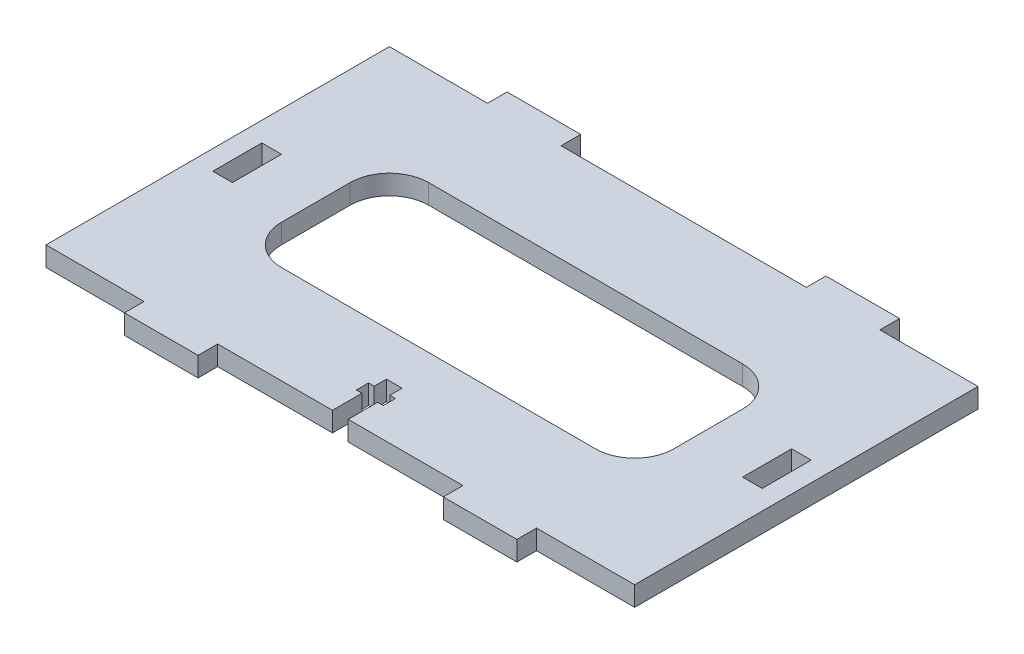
ISO-10303-21;
HEADER;
FILE_DESCRIPTION(('STEP AP214'),'2;1');
FILE_NAME('part.step','',(''),(''),'','','');
FILE_SCHEMA(('AUTOMOTIVE_DESIGN { 1 0 10303 214 1 1 1 1 }'));
ENDSEC;
DATA;
#1=APPLICATION_CONTEXT('core data for automotive mechanical design processes');
#2=APPLICATION_PROTOCOL_DEFINITION('international standard','automotive_design',2000,#1);
#3=PRODUCT_CONTEXT('',#1,'mechanical');
#4=PRODUCT('Part','Part','',(#3));
#5=PRODUCT_RELATED_PRODUCT_CATEGORY('part','',(#4));
#6=PRODUCT_DEFINITION_FORMATION('','',#4);
#7=PRODUCT_DEFINITION_CONTEXT('part definition',#1,'design');
#8=PRODUCT_DEFINITION('design','',#6,#7);
#9=PRODUCT_DEFINITION_SHAPE('','',#8);
#10=(LENGTH_UNIT() NAMED_UNIT(*) SI_UNIT(.MILLI.,.METRE.));
#11=(NAMED_UNIT(*) PLANE_ANGLE_UNIT() SI_UNIT($,.RADIAN.));
#12=(NAMED_UNIT(*) SI_UNIT($,.STERADIAN.) SOLID_ANGLE_UNIT());
#13=UNCERTAINTY_MEASURE_WITH_UNIT(LENGTH_MEASURE(1.E-05),#10,'distance_accuracy_value','');
#14=(GEOMETRIC_REPRESENTATION_CONTEXT(3) GLOBAL_UNCERTAINTY_ASSIGNED_CONTEXT((#13)) GLOBAL_UNIT_ASSIGNED_CONTEXT((#10,
#11,#12)) REPRESENTATION_CONTEXT('',''));
#15=CARTESIAN_POINT('',(0.,0.,0.));
#16=DIRECTION('',(0.,0.,1.));
#17=DIRECTION('',(1.,0.,0.));
#18=AXIS2_PLACEMENT_3D('',#15,#16,#17);
#19=CARTESIAN_POINT('',(0.,4.,0.));
#20=DIRECTION('',(0.,1.,0.));
#21=DIRECTION('',(0.,0.,1.));
#22=AXIS2_PLACEMENT_3D('',#19,#20,#21);
#23=PLANE('',#22);
#24=DIRECTION('',(1.,0.,0.));
#25=VECTOR('',#24,1.);
#26=CARTESIAN_POINT('',(-56.,4.,5.));
#27=LINE('',#26,#25);
#28=CARTESIAN_POINT('',(-56.,4.,5.));
#29=VERTEX_POINT('',#28);
#30=CARTESIAN_POINT('',(-52.,4.,5.));
#31=VERTEX_POINT('',#30);
#32=EDGE_CURVE('E376',#29,#31,#27,.T.);
#33=ORIENTED_EDGE('',*,*,#32,.F.);
#34=DIRECTION('',(0.,0.,1.));
#35=VECTOR('',#34,1.);
#36=CARTESIAN_POINT('',(-56.,4.,-5.));
#37=LINE('',#36,#35);
#38=CARTESIAN_POINT('',(-56.,4.,-5.));
#39=VERTEX_POINT('',#38);
#40=EDGE_CURVE('E374',#39,#29,#37,.T.);
#41=ORIENTED_EDGE('',*,*,#40,.F.);
#42=DIRECTION('',(-1.,0.,0.));
#43=VECTOR('',#42,1.);
#44=CARTESIAN_POINT('',(-56.,4.,-5.));
#45=LINE('',#44,#43);
#46=CARTESIAN_POINT('',(-52.,4.,-5.));
#47=VERTEX_POINT('',#46);
#48=EDGE_CURVE('E382',#47,#39,#45,.T.);
#49=ORIENTED_EDGE('',*,*,#48,.F.);
#50=DIRECTION('',(0.,0.,-1.));
#51=VECTOR('',#50,1.);
#52=CARTESIAN_POINT('',(-52.,4.,-5.));
#53=LINE('',#52,#51);
#54=EDGE_CURVE('E379',#31,#47,#53,.T.);
#55=ORIENTED_EDGE('',*,*,#54,.F.);
#56=EDGE_LOOP('',(#33,#41,#49,#55));
#57=FACE_BOUND('',#56,.T.);
#58=DIRECTION('',(0.,0.,1.));
#59=VECTOR('',#58,1.);
#60=CARTESIAN_POINT('',(-60.,4.,-35.));
#61=LINE('',#60,#59);
#62=CARTESIAN_POINT('',(-60.,4.,-35.));
#63=VERTEX_POINT('',#62);
#64=CARTESIAN_POINT('',(-60.,4.,35.));
#65=VERTEX_POINT('',#64);
#66=EDGE_CURVE('E464',#63,#65,#61,.T.);
#67=ORIENTED_EDGE('',*,*,#66,.T.);
#68=DIRECTION('',(1.,0.,0.));
#69=VECTOR('',#68,1.);
#70=CARTESIAN_POINT('',(-60.,4.,35.));
#71=LINE('',#70,#69);
#72=CARTESIAN_POINT('',(-40.,4.,35.));
#73=VERTEX_POINT('',#72);
#74=EDGE_CURVE('E467',#65,#73,#71,.T.);
#75=ORIENTED_EDGE('',*,*,#74,.T.);
#76=DIRECTION('',(0.,0.,1.));
#77=VECTOR('',#76,1.);
#78=CARTESIAN_POINT('',(-40.,4.,39.));
#79=LINE('',#78,#77);
#80=CARTESIAN_POINT('',(-40.,4.,39.));
#81=VERTEX_POINT('',#80);
#82=EDGE_CURVE('E470',#73,#81,#79,.T.);
#83=ORIENTED_EDGE('',*,*,#82,.T.);
#84=DIRECTION('',(1.,0.,0.));
#85=VECTOR('',#84,1.);
#86=CARTESIAN_POINT('',(-40.,4.,39.));
#87=LINE('',#86,#85);
#88=CARTESIAN_POINT('',(-25.,4.,39.));
#89=VERTEX_POINT('',#88);
#90=EDGE_CURVE('E472',#81,#89,#87,.T.);
#91=ORIENTED_EDGE('',*,*,#90,.T.);
#92=DIRECTION('',(0.,0.,-1.));
#93=VECTOR('',#92,1.);
#94=CARTESIAN_POINT('',(-25.,4.,39.));
#95=LINE('',#94,#93);
#96=CARTESIAN_POINT('',(-25.,4.,35.));
#97=VERTEX_POINT('',#96);
#98=EDGE_CURVE('E474',#89,#97,#95,.T.);
#99=ORIENTED_EDGE('',*,*,#98,.T.);
#100=DIRECTION('',(1.,0.,0.));
#101=VECTOR('',#100,1.);
#102=CARTESIAN_POINT('',(-25.,4.,35.));
#103=LINE('',#102,#101);
#104=CARTESIAN_POINT('',(-1.59999999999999,4.,35.));
#105=VERTEX_POINT('',#104);
#106=EDGE_CURVE('E476',#97,#105,#103,.T.);
#107=ORIENTED_EDGE('',*,*,#106,.T.);
#108=DIRECTION('',(0.,0.,-1.));
#109=VECTOR('',#108,1.);
#110=CARTESIAN_POINT('',(-1.59999999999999,4.,29.));
#111=LINE('',#110,#109);
#112=CARTESIAN_POINT('',(-1.59999999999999,4.,29.));
#113=VERTEX_POINT('',#112);
#114=EDGE_CURVE('E478',#105,#113,#111,.T.);
#115=ORIENTED_EDGE('',*,*,#114,.T.);
#116=DIRECTION('',(-1.,0.,0.));
#117=VECTOR('',#116,1.);
#118=CARTESIAN_POINT('',(-2.74999999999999,4.,29.));
#119=LINE('',#118,#117);
#120=CARTESIAN_POINT('',(-2.74999999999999,4.,29.));
#121=VERTEX_POINT('',#120);
#122=EDGE_CURVE('E480',#113,#121,#119,.T.);
#123=ORIENTED_EDGE('',*,*,#122,.T.);
#124=DIRECTION('',(0.,0.,-1.));
#125=VECTOR('',#124,1.);
#126=CARTESIAN_POINT('',(-2.74999999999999,4.,26.5));
#127=LINE('',#126,#125);
#128=CARTESIAN_POINT('',(-2.74999999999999,4.,26.5));
#129=VERTEX_POINT('',#128);
#130=EDGE_CURVE('E482',#121,#129,#127,.T.);
#131=ORIENTED_EDGE('',*,*,#130,.T.);
#132=DIRECTION('',(1.,0.,0.));
#133=VECTOR('',#132,1.);
#134=CARTESIAN_POINT('',(-2.74999999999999,4.,26.5));
#135=LINE('',#134,#133);
#136=CARTESIAN_POINT('',(-1.59999999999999,4.,26.5));
#137=VERTEX_POINT('',#136);
#138=EDGE_CURVE('E484',#129,#137,#135,.T.);
#139=ORIENTED_EDGE('',*,*,#138,.T.);
#140=DIRECTION('',(0.,0.,-1.));
#141=VECTOR('',#140,1.);
#142=CARTESIAN_POINT('',(-1.59999999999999,4.,24.));
#143=LINE('',#142,#141);
#144=CARTESIAN_POINT('',(-1.59999999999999,4.,24.));
#145=VERTEX_POINT('',#144);
#146=EDGE_CURVE('E486',#137,#145,#143,.T.);
#147=ORIENTED_EDGE('',*,*,#146,.T.);
#148=DIRECTION('',(1.,0.,0.));
#149=VECTOR('',#148,1.);
#150=CARTESIAN_POINT('',(-1.59999999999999,4.,24.));
#151=LINE('',#150,#149);
#152=CARTESIAN_POINT('',(1.60000000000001,4.,24.));
#153=VERTEX_POINT('',#152);
#154=EDGE_CURVE('E488',#145,#153,#151,.T.);
#155=ORIENTED_EDGE('',*,*,#154,.T.);
#156=DIRECTION('',(0.,0.,1.));
#157=VECTOR('',#156,1.);
#158=CARTESIAN_POINT('',(1.60000000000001,4.,24.));
#159=LINE('',#158,#157);
#160=CARTESIAN_POINT('',(1.60000000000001,4.,26.5));
#161=VERTEX_POINT('',#160);
#162=EDGE_CURVE('E490',#153,#161,#159,.T.);
#163=ORIENTED_EDGE('',*,*,#162,.T.);
#164=DIRECTION('',(1.,0.,0.));
#165=VECTOR('',#164,1.);
#166=CARTESIAN_POINT('',(1.60000000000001,4.,26.5));
#167=LINE('',#166,#165);
#168=CARTESIAN_POINT('',(2.75000000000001,4.,26.5));
#169=VERTEX_POINT('',#168);
#170=EDGE_CURVE('E492',#161,#169,#167,.T.);
#171=ORIENTED_EDGE('',*,*,#170,.T.);
#172=DIRECTION('',(0.,0.,1.));
#173=VECTOR('',#172,1.);
#174=CARTESIAN_POINT('',(2.75000000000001,4.,26.5));
#175=LINE('',#174,#173);
#176=CARTESIAN_POINT('',(2.75000000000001,4.,29.));
#177=VERTEX_POINT('',#176);
#178=EDGE_CURVE('E494',#169,#177,#175,.T.);
#179=ORIENTED_EDGE('',*,*,#178,.T.);
#180=DIRECTION('',(-1.,0.,0.));
#181=VECTOR('',#180,1.);
#182=CARTESIAN_POINT('',(1.60000000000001,4.,29.));
#183=LINE('',#182,#181);
#184=CARTESIAN_POINT('',(1.60000000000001,4.,29.));
#185=VERTEX_POINT('',#184);
#186=EDGE_CURVE('E496',#177,#185,#183,.T.);
#187=ORIENTED_EDGE('',*,*,#186,.T.);
#188=DIRECTION('',(0.,0.,1.));
#189=VECTOR('',#188,1.);
#190=CARTESIAN_POINT('',(1.60000000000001,4.,29.));
#191=LINE('',#190,#189);
#192=CARTESIAN_POINT('',(1.60000000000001,4.,35.));
#193=VERTEX_POINT('',#192);
#194=EDGE_CURVE('E498',#185,#193,#191,.T.);
#195=ORIENTED_EDGE('',*,*,#194,.T.);
#196=DIRECTION('',(1.,0.,0.));
#197=VECTOR('',#196,1.);
#198=CARTESIAN_POINT('',(1.60000000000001,4.,35.));
#199=LINE('',#198,#197);
#200=CARTESIAN_POINT('',(25.,4.,35.));
#201=VERTEX_POINT('',#200);
#202=EDGE_CURVE('E500',#193,#201,#199,.T.);
#203=ORIENTED_EDGE('',*,*,#202,.T.);
#204=DIRECTION('',(0.,0.,1.));
#205=VECTOR('',#204,1.);
#206=CARTESIAN_POINT('',(25.,4.,39.));
#207=LINE('',#206,#205);
#208=CARTESIAN_POINT('',(25.,4.,39.));
#209=VERTEX_POINT('',#208);
#210=EDGE_CURVE('E502',#201,#209,#207,.T.);
#211=ORIENTED_EDGE('',*,*,#210,.T.);
#212=DIRECTION('',(1.,0.,0.));
#213=VECTOR('',#212,1.);
#214=CARTESIAN_POINT('',(40.,4.,39.));
#215=LINE('',#214,#213);
#216=CARTESIAN_POINT('',(40.,4.,39.));
#217=VERTEX_POINT('',#216);
#218=EDGE_CURVE('E504',#209,#217,#215,.T.);
#219=ORIENTED_EDGE('',*,*,#218,.T.);
#220=DIRECTION('',(0.,0.,-1.));
#221=VECTOR('',#220,1.);
#222=CARTESIAN_POINT('',(40.,4.,39.));
#223=LINE('',#222,#221);
#224=CARTESIAN_POINT('',(40.,4.,35.));
#225=VERTEX_POINT('',#224);
#226=EDGE_CURVE('E506',#217,#225,#223,.T.);
#227=ORIENTED_EDGE('',*,*,#226,.T.);
#228=DIRECTION('',(1.,0.,0.));
#229=VECTOR('',#228,1.);
#230=CARTESIAN_POINT('',(40.,4.,35.));
#231=LINE('',#230,#229);
#232=CARTESIAN_POINT('',(60.,4.,35.));
#233=VERTEX_POINT('',#232);
#234=EDGE_CURVE('E508',#225,#233,#231,.T.);
#235=ORIENTED_EDGE('',*,*,#234,.T.);
#236=DIRECTION('',(0.,0.,-1.));
#237=VECTOR('',#236,1.);
#238=CARTESIAN_POINT('',(60.,4.,-35.));
#239=LINE('',#238,#237);
#240=CARTESIAN_POINT('',(60.,4.,-35.));
#241=VERTEX_POINT('',#240);
#242=EDGE_CURVE('E510',#233,#241,#239,.T.);
#243=ORIENTED_EDGE('',*,*,#242,.T.);
#244=DIRECTION('',(-1.,0.,0.));
#245=VECTOR('',#244,1.);
#246=CARTESIAN_POINT('',(40.,4.,-35.));
#247=LINE('',#246,#245);
#248=CARTESIAN_POINT('',(40.,4.,-35.));
#249=VERTEX_POINT('',#248);
#250=EDGE_CURVE('E512',#241,#249,#247,.T.);
#251=ORIENTED_EDGE('',*,*,#250,.T.);
#252=DIRECTION('',(0.,0.,-1.));
#253=VECTOR('',#252,1.);
#254=CARTESIAN_POINT('',(40.,4.,-39.));
#255=LINE('',#254,#253);
#256=CARTESIAN_POINT('',(40.,4.,-39.));
#257=VERTEX_POINT('',#256);
#258=EDGE_CURVE('E514',#249,#257,#255,.T.);
#259=ORIENTED_EDGE('',*,*,#258,.T.);
#260=DIRECTION('',(-1.,0.,0.));
#261=VECTOR('',#260,1.);
#262=CARTESIAN_POINT('',(40.,4.,-39.));
#263=LINE('',#262,#261);
#264=CARTESIAN_POINT('',(25.,4.,-39.));
#265=VERTEX_POINT('',#264);
#266=EDGE_CURVE('E516',#257,#265,#263,.T.);
#267=ORIENTED_EDGE('',*,*,#266,.T.);
#268=DIRECTION('',(0.,0.,1.));
#269=VECTOR('',#268,1.);
#270=CARTESIAN_POINT('',(25.,4.,-39.));
#271=LINE('',#270,#269);
#272=CARTESIAN_POINT('',(25.,4.,-35.));
#273=VERTEX_POINT('',#272);
#274=EDGE_CURVE('E518',#265,#273,#271,.T.);
#275=ORIENTED_EDGE('',*,*,#274,.T.);
#276=DIRECTION('',(-1.,0.,0.));
#277=VECTOR('',#276,1.);
#278=CARTESIAN_POINT('',(-25.,4.,-35.));
#279=LINE('',#278,#277);
#280=CARTESIAN_POINT('',(-25.,4.,-35.));
#281=VERTEX_POINT('',#280);
#282=EDGE_CURVE('E520',#273,#281,#279,.T.);
#283=ORIENTED_EDGE('',*,*,#282,.T.);
#284=DIRECTION('',(0.,0.,-1.));
#285=VECTOR('',#284,1.);
#286=CARTESIAN_POINT('',(-25.,4.,-39.));
#287=LINE('',#286,#285);
#288=CARTESIAN_POINT('',(-25.,4.,-39.));
#289=VERTEX_POINT('',#288);
#290=EDGE_CURVE('E522',#281,#289,#287,.T.);
#291=ORIENTED_EDGE('',*,*,#290,.T.);
#292=DIRECTION('',(-1.,0.,0.));
#293=VECTOR('',#292,1.);
#294=CARTESIAN_POINT('',(-40.,4.,-39.));
#295=LINE('',#294,#293);
#296=CARTESIAN_POINT('',(-40.,4.,-39.));
#297=VERTEX_POINT('',#296);
#298=EDGE_CURVE('E524',#289,#297,#295,.T.);
#299=ORIENTED_EDGE('',*,*,#298,.T.);
#300=DIRECTION('',(0.,0.,1.));
#301=VECTOR('',#300,1.);
#302=CARTESIAN_POINT('',(-40.,4.,-39.));
#303=LINE('',#302,#301);
#304=CARTESIAN_POINT('',(-40.,4.,-35.));
#305=VERTEX_POINT('',#304);
#306=EDGE_CURVE('E526',#297,#305,#303,.T.);
#307=ORIENTED_EDGE('',*,*,#306,.T.);
#308=DIRECTION('',(-1.,0.,0.));
#309=VECTOR('',#308,1.);
#310=CARTESIAN_POINT('',(-60.,4.,-35.));
#311=LINE('',#310,#309);
#312=EDGE_CURVE('E528',#305,#63,#311,.T.);
#313=ORIENTED_EDGE('',*,*,#312,.T.);
#314=EDGE_LOOP('',(#67,#75,#83,#91,#99,#107,#115,#123,#131,#139,#147,#155,#163,#171,#179,#187,
#195,#203,#211,#219,#227,#235,#243,#251,#259,#267,#275,#283,#291,#299,#307,#313));
#315=FACE_BOUND('',#314,.T.);
#316=DIRECTION('',(1.,0.,0.));
#317=VECTOR('',#316,1.);
#318=CARTESIAN_POINT('',(-32.,4.,15.));
#319=LINE('',#318,#317);
#320=CARTESIAN_POINT('',(-32.,4.,15.));
#321=VERTEX_POINT('',#320);
#322=CARTESIAN_POINT('',(32.,4.,15.));
#323=VERTEX_POINT('',#322);
#324=EDGE_CURVE('E407',#321,#323,#319,.T.);
#325=ORIENTED_EDGE('',*,*,#324,.F.);
#326=CARTESIAN_POINT('',(-32.,4.,7.));
#327=DIRECTION('',(0.,1.,0.));
#328=DIRECTION('',(0.,0.,1.));
#329=AXIS2_PLACEMENT_3D('',#326,#327,#328);
#330=CIRCLE('',#329,8.);
#331=CARTESIAN_POINT('',(-40.,4.,7.));
#332=VERTEX_POINT('',#331);
#333=EDGE_CURVE('E405',#332,#321,#330,.T.);
#334=ORIENTED_EDGE('',*,*,#333,.F.);
#335=DIRECTION('',(0.,0.,1.));
#336=VECTOR('',#335,1.);
#337=CARTESIAN_POINT('',(-40.,4.,-7.));
#338=LINE('',#337,#336);
#339=CARTESIAN_POINT('',(-40.,4.,-7.));
#340=VERTEX_POINT('',#339);
#341=EDGE_CURVE('E421',#340,#332,#338,.T.);
#342=ORIENTED_EDGE('',*,*,#341,.F.);
#343=CARTESIAN_POINT('',(-32.,4.,-7.));
#344=DIRECTION('',(0.,1.,0.));
#345=DIRECTION('',(0.,0.,1.));
#346=AXIS2_PLACEMENT_3D('',#343,#344,#345);
#347=CIRCLE('',#346,8.);
#348=CARTESIAN_POINT('',(-32.,4.,-15.));
#349=VERTEX_POINT('',#348);
#350=EDGE_CURVE('E418',#349,#340,#347,.T.);
#351=ORIENTED_EDGE('',*,*,#350,.F.);
#352=DIRECTION('',(-1.,0.,0.));
#353=VECTOR('',#352,1.);
#354=CARTESIAN_POINT('',(-32.,4.,-15.));
#355=LINE('',#354,#353);
#356=CARTESIAN_POINT('',(32.,4.,-15.));
#357=VERTEX_POINT('',#356);
#358=EDGE_CURVE('E416',#357,#349,#355,.T.);
#359=ORIENTED_EDGE('',*,*,#358,.F.);
#360=CARTESIAN_POINT('',(32.,4.,-7.));
#361=DIRECTION('',(0.,1.,0.));
#362=DIRECTION('',(0.,0.,1.));
#363=AXIS2_PLACEMENT_3D('',#360,#361,#362);
#364=CIRCLE('',#363,8.);
#365=CARTESIAN_POINT('',(40.,4.,-7.));
#366=VERTEX_POINT('',#365);
#367=EDGE_CURVE('E414',#366,#357,#364,.T.);
#368=ORIENTED_EDGE('',*,*,#367,.F.);
#369=DIRECTION('',(0.,0.,-1.));
#370=VECTOR('',#369,1.);
#371=CARTESIAN_POINT('',(40.,4.,-7.));
#372=LINE('',#371,#370);
#373=CARTESIAN_POINT('',(40.,4.,7.));
#374=VERTEX_POINT('',#373);
#375=EDGE_CURVE('E412',#374,#366,#372,.T.);
#376=ORIENTED_EDGE('',*,*,#375,.F.);
#377=CARTESIAN_POINT('',(32.,4.,7.));
#378=DIRECTION('',(0.,1.,0.));
#379=DIRECTION('',(0.,0.,1.));
#380=AXIS2_PLACEMENT_3D('',#377,#378,#379);
#381=CIRCLE('',#380,8.);
#382=EDGE_CURVE('E410',#323,#374,#381,.T.);
#383=ORIENTED_EDGE('',*,*,#382,.F.);
#384=EDGE_LOOP('',(#325,#334,#342,#351,#359,#368,#376,#383));
#385=FACE_BOUND('',#384,.T.);
#386=DIRECTION('',(-1.,0.,0.));
#387=VECTOR('',#386,1.);
#388=CARTESIAN_POINT('',(56.,4.,-5.00000000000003));
#389=LINE('',#388,#387);
#390=CARTESIAN_POINT('',(56.,4.,-5.00000000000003));
#391=VERTEX_POINT('',#390);
#392=CARTESIAN_POINT('',(52.,4.,-5.00000000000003));
#393=VERTEX_POINT('',#392);
#394=EDGE_CURVE('E346',#391,#393,#389,.T.);
#395=ORIENTED_EDGE('',*,*,#394,.F.);
#396=DIRECTION('',(0.,0.,-1.));
#397=VECTOR('',#396,1.);
#398=CARTESIAN_POINT('',(56.,4.,-5.00000000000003));
#399=LINE('',#398,#397);
#400=CARTESIAN_POINT('',(56.,4.,4.99999999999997));
#401=VERTEX_POINT('',#400);
#402=EDGE_CURVE('E338',#401,#391,#399,.T.);
#403=ORIENTED_EDGE('',*,*,#402,.F.);
#404=DIRECTION('',(1.,0.,0.));
#405=VECTOR('',#404,1.);
#406=CARTESIAN_POINT('',(56.,4.,4.99999999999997));
#407=LINE('',#406,#405);
#408=CARTESIAN_POINT('',(52.,4.,4.99999999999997));
#409=VERTEX_POINT('',#408);
#410=EDGE_CURVE('E360',#409,#401,#407,.T.);
#411=ORIENTED_EDGE('',*,*,#410,.F.);
#412=DIRECTION('',(0.,0.,1.));
#413=VECTOR('',#412,1.);
#414=CARTESIAN_POINT('',(52.,4.,-5.00000000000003));
#415=LINE('',#414,#413);
#416=EDGE_CURVE('E358',#393,#409,#415,.T.);
#417=ORIENTED_EDGE('',*,*,#416,.F.);
#418=EDGE_LOOP('',(#395,#403,#411,#417));
#419=FACE_BOUND('',#418,.T.);
#420=ADVANCED_FACE('F33',(#57,#315,#385,#419),#23,.T.);
#421=CARTESIAN_POINT('',(0.,0.,0.));
#422=DIRECTION('',(0.,1.,0.));
#423=DIRECTION('',(0.,0.,1.));
#424=AXIS2_PLACEMENT_3D('',#421,#422,#423);
#425=PLANE('',#424);
#426=DIRECTION('',(0.,0.,1.));
#427=VECTOR('',#426,1.);
#428=CARTESIAN_POINT('',(-56.,0.,-5.));
#429=LINE('',#428,#427);
#430=CARTESIAN_POINT('',(-56.,0.,-5.));
#431=VERTEX_POINT('',#430);
#432=CARTESIAN_POINT('',(-56.,0.,5.));
#433=VERTEX_POINT('',#432);
#434=EDGE_CURVE('E354',#431,#433,#429,.T.);
#435=ORIENTED_EDGE('',*,*,#434,.T.);
#436=DIRECTION('',(1.,0.,0.));
#437=VECTOR('',#436,1.);
#438=CARTESIAN_POINT('',(-56.,0.,5.));
#439=LINE('',#438,#437);
#440=CARTESIAN_POINT('',(-52.,0.,5.));
#441=VERTEX_POINT('',#440);
#442=EDGE_CURVE('E387',#433,#441,#439,.T.);
#443=ORIENTED_EDGE('',*,*,#442,.T.);
#444=DIRECTION('',(0.,0.,-1.));
#445=VECTOR('',#444,1.);
#446=CARTESIAN_POINT('',(-52.,0.,-5.));
#447=LINE('',#446,#445);
#448=CARTESIAN_POINT('',(-52.,0.,-5.));
#449=VERTEX_POINT('',#448);
#450=EDGE_CURVE('E390',#441,#449,#447,.T.);
#451=ORIENTED_EDGE('',*,*,#450,.T.);
#452=DIRECTION('',(-1.,0.,0.));
#453=VECTOR('',#452,1.);
#454=CARTESIAN_POINT('',(-56.,0.,-5.));
#455=LINE('',#454,#453);
#456=EDGE_CURVE('E377',#449,#431,#455,.T.);
#457=ORIENTED_EDGE('',*,*,#456,.T.);
#458=EDGE_LOOP('',(#435,#443,#451,#457));
#459=FACE_BOUND('',#458,.T.);
#460=DIRECTION('',(0.,0.,1.));
#461=VECTOR('',#460,1.);
#462=CARTESIAN_POINT('',(-60.,0.,-35.));
#463=LINE('',#462,#461);
#464=CARTESIAN_POINT('',(-60.,0.,-35.));
#465=VERTEX_POINT('',#464);
#466=CARTESIAN_POINT('',(-60.,0.,35.));
#467=VERTEX_POINT('',#466);
#468=EDGE_CURVE('E463',#465,#467,#463,.T.);
#469=ORIENTED_EDGE('',*,*,#468,.F.);
#470=DIRECTION('',(-1.,0.,0.));
#471=VECTOR('',#470,1.);
#472=CARTESIAN_POINT('',(-60.,0.,-35.));
#473=LINE('',#472,#471);
#474=CARTESIAN_POINT('',(-40.,0.,-35.));
#475=VERTEX_POINT('',#474);
#476=EDGE_CURVE('E468',#475,#465,#473,.T.);
#477=ORIENTED_EDGE('',*,*,#476,.F.);
#478=DIRECTION('',(0.,0.,1.));
#479=VECTOR('',#478,1.);
#480=CARTESIAN_POINT('',(-40.,0.,-39.));
#481=LINE('',#480,#479);
#482=CARTESIAN_POINT('',(-40.,0.,-39.));
#483=VERTEX_POINT('',#482);
#484=EDGE_CURVE('E591',#483,#475,#481,.T.);
#485=ORIENTED_EDGE('',*,*,#484,.F.);
#486=DIRECTION('',(-1.,0.,0.));
#487=VECTOR('',#486,1.);
#488=CARTESIAN_POINT('',(-40.,0.,-39.));
#489=LINE('',#488,#487);
#490=CARTESIAN_POINT('',(-25.,0.,-39.));
#491=VERTEX_POINT('',#490);
#492=EDGE_CURVE('E589',#491,#483,#489,.T.);
#493=ORIENTED_EDGE('',*,*,#492,.F.);
#494=DIRECTION('',(0.,0.,-1.));
#495=VECTOR('',#494,1.);
#496=CARTESIAN_POINT('',(-25.,0.,-39.));
#497=LINE('',#496,#495);
#498=CARTESIAN_POINT('',(-25.,0.,-35.));
#499=VERTEX_POINT('',#498);
#500=EDGE_CURVE('E587',#499,#491,#497,.T.);
#501=ORIENTED_EDGE('',*,*,#500,.F.);
#502=DIRECTION('',(-1.,0.,0.));
#503=VECTOR('',#502,1.);
#504=CARTESIAN_POINT('',(-25.,0.,-35.));
#505=LINE('',#504,#503);
#506=CARTESIAN_POINT('',(25.,0.,-35.));
#507=VERTEX_POINT('',#506);
#508=EDGE_CURVE('E585',#507,#499,#505,.T.);
#509=ORIENTED_EDGE('',*,*,#508,.F.);
#510=DIRECTION('',(0.,0.,1.));
#511=VECTOR('',#510,1.);
#512=CARTESIAN_POINT('',(25.,0.,-39.));
#513=LINE('',#512,#511);
#514=CARTESIAN_POINT('',(25.,0.,-39.));
#515=VERTEX_POINT('',#514);
#516=EDGE_CURVE('E583',#515,#507,#513,.T.);
#517=ORIENTED_EDGE('',*,*,#516,.F.);
#518=DIRECTION('',(-1.,0.,0.));
#519=VECTOR('',#518,1.);
#520=CARTESIAN_POINT('',(40.,0.,-39.));
#521=LINE('',#520,#519);
#522=CARTESIAN_POINT('',(40.,0.,-39.));
#523=VERTEX_POINT('',#522);
#524=EDGE_CURVE('E581',#523,#515,#521,.T.);
#525=ORIENTED_EDGE('',*,*,#524,.F.);
#526=DIRECTION('',(0.,0.,-1.));
#527=VECTOR('',#526,1.);
#528=CARTESIAN_POINT('',(40.,0.,-39.));
#529=LINE('',#528,#527);
#530=CARTESIAN_POINT('',(40.,0.,-35.));
#531=VERTEX_POINT('',#530);
#532=EDGE_CURVE('E579',#531,#523,#529,.T.);
#533=ORIENTED_EDGE('',*,*,#532,.F.);
#534=DIRECTION('',(-1.,0.,0.));
#535=VECTOR('',#534,1.);
#536=CARTESIAN_POINT('',(40.,0.,-35.));
#537=LINE('',#536,#535);
#538=CARTESIAN_POINT('',(60.,0.,-35.));
#539=VERTEX_POINT('',#538);
#540=EDGE_CURVE('E577',#539,#531,#537,.T.);
#541=ORIENTED_EDGE('',*,*,#540,.F.);
#542=DIRECTION('',(0.,0.,-1.));
#543=VECTOR('',#542,1.);
#544=CARTESIAN_POINT('',(60.,0.,-35.));
#545=LINE('',#544,#543);
#546=CARTESIAN_POINT('',(60.,0.,35.));
#547=VERTEX_POINT('',#546);
#548=EDGE_CURVE('E575',#547,#539,#545,.T.);
#549=ORIENTED_EDGE('',*,*,#548,.F.);
#550=DIRECTION('',(1.,0.,0.));
#551=VECTOR('',#550,1.);
#552=CARTESIAN_POINT('',(40.,0.,35.));
#553=LINE('',#552,#551);
#554=CARTESIAN_POINT('',(40.,0.,35.));
#555=VERTEX_POINT('',#554);
#556=EDGE_CURVE('E573',#555,#547,#553,.T.);
#557=ORIENTED_EDGE('',*,*,#556,.F.);
#558=DIRECTION('',(0.,0.,-1.));
#559=VECTOR('',#558,1.);
#560=CARTESIAN_POINT('',(40.,0.,39.));
#561=LINE('',#560,#559);
#562=CARTESIAN_POINT('',(40.,0.,39.));
#563=VERTEX_POINT('',#562);
#564=EDGE_CURVE('E571',#563,#555,#561,.T.);
#565=ORIENTED_EDGE('',*,*,#564,.F.);
#566=DIRECTION('',(1.,0.,0.));
#567=VECTOR('',#566,1.);
#568=CARTESIAN_POINT('',(40.,0.,39.));
#569=LINE('',#568,#567);
#570=CARTESIAN_POINT('',(25.,0.,39.));
#571=VERTEX_POINT('',#570);
#572=EDGE_CURVE('E569',#571,#563,#569,.T.);
#573=ORIENTED_EDGE('',*,*,#572,.F.);
#574=DIRECTION('',(0.,0.,1.));
#575=VECTOR('',#574,1.);
#576=CARTESIAN_POINT('',(25.,0.,39.));
#577=LINE('',#576,#575);
#578=CARTESIAN_POINT('',(25.,0.,35.));
#579=VERTEX_POINT('',#578);
#580=EDGE_CURVE('E567',#579,#571,#577,.T.);
#581=ORIENTED_EDGE('',*,*,#580,.F.);
#582=DIRECTION('',(1.,0.,0.));
#583=VECTOR('',#582,1.);
#584=CARTESIAN_POINT('',(1.60000000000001,0.,35.));
#585=LINE('',#584,#583);
#586=CARTESIAN_POINT('',(1.60000000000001,0.,35.));
#587=VERTEX_POINT('',#586);
#588=EDGE_CURVE('E565',#587,#579,#585,.T.);
#589=ORIENTED_EDGE('',*,*,#588,.F.);
#590=DIRECTION('',(0.,0.,1.));
#591=VECTOR('',#590,1.);
#592=CARTESIAN_POINT('',(1.60000000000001,0.,29.));
#593=LINE('',#592,#591);
#594=CARTESIAN_POINT('',(1.60000000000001,0.,29.));
#595=VERTEX_POINT('',#594);
#596=EDGE_CURVE('E563',#595,#587,#593,.T.);
#597=ORIENTED_EDGE('',*,*,#596,.F.);
#598=DIRECTION('',(-1.,0.,0.));
#599=VECTOR('',#598,1.);
#600=CARTESIAN_POINT('',(1.60000000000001,0.,29.));
#601=LINE('',#600,#599);
#602=CARTESIAN_POINT('',(2.75000000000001,0.,29.));
#603=VERTEX_POINT('',#602);
#604=EDGE_CURVE('E561',#603,#595,#601,.T.);
#605=ORIENTED_EDGE('',*,*,#604,.F.);
#606=DIRECTION('',(0.,0.,1.));
#607=VECTOR('',#606,1.);
#608=CARTESIAN_POINT('',(2.75000000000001,0.,26.5));
#609=LINE('',#608,#607);
#610=CARTESIAN_POINT('',(2.75000000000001,0.,26.5));
#611=VERTEX_POINT('',#610);
#612=EDGE_CURVE('E559',#611,#603,#609,.T.);
#613=ORIENTED_EDGE('',*,*,#612,.F.);
#614=DIRECTION('',(1.,0.,0.));
#615=VECTOR('',#614,1.);
#616=CARTESIAN_POINT('',(1.60000000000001,0.,26.5));
#617=LINE('',#616,#615);
#618=CARTESIAN_POINT('',(1.60000000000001,0.,26.5));
#619=VERTEX_POINT('',#618);
#620=EDGE_CURVE('E557',#619,#611,#617,.T.);
#621=ORIENTED_EDGE('',*,*,#620,.F.);
#622=DIRECTION('',(0.,0.,1.));
#623=VECTOR('',#622,1.);
#624=CARTESIAN_POINT('',(1.60000000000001,0.,24.));
#625=LINE('',#624,#623);
#626=CARTESIAN_POINT('',(1.60000000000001,0.,24.));
#627=VERTEX_POINT('',#626);
#628=EDGE_CURVE('E555',#627,#619,#625,.T.);
#629=ORIENTED_EDGE('',*,*,#628,.F.);
#630=DIRECTION('',(1.,0.,0.));
#631=VECTOR('',#630,1.);
#632=CARTESIAN_POINT('',(-1.59999999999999,0.,24.));
#633=LINE('',#632,#631);
#634=CARTESIAN_POINT('',(-1.59999999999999,0.,24.));
#635=VERTEX_POINT('',#634);
#636=EDGE_CURVE('E553',#635,#627,#633,.T.);
#637=ORIENTED_EDGE('',*,*,#636,.F.);
#638=DIRECTION('',(0.,0.,-1.));
#639=VECTOR('',#638,1.);
#640=CARTESIAN_POINT('',(-1.59999999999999,0.,24.));
#641=LINE('',#640,#639);
#642=CARTESIAN_POINT('',(-1.59999999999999,0.,26.5));
#643=VERTEX_POINT('',#642);
#644=EDGE_CURVE('E551',#643,#635,#641,.T.);
#645=ORIENTED_EDGE('',*,*,#644,.F.);
#646=DIRECTION('',(1.,0.,0.));
#647=VECTOR('',#646,1.);
#648=CARTESIAN_POINT('',(-2.74999999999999,0.,26.5));
#649=LINE('',#648,#647);
#650=CARTESIAN_POINT('',(-2.74999999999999,0.,26.5));
#651=VERTEX_POINT('',#650);
#652=EDGE_CURVE('E549',#651,#643,#649,.T.);
#653=ORIENTED_EDGE('',*,*,#652,.F.);
#654=DIRECTION('',(0.,0.,-1.));
#655=VECTOR('',#654,1.);
#656=CARTESIAN_POINT('',(-2.74999999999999,0.,26.5));
#657=LINE('',#656,#655);
#658=CARTESIAN_POINT('',(-2.74999999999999,0.,29.));
#659=VERTEX_POINT('',#658);
#660=EDGE_CURVE('E547',#659,#651,#657,.T.);
#661=ORIENTED_EDGE('',*,*,#660,.F.);
#662=DIRECTION('',(-1.,0.,0.));
#663=VECTOR('',#662,1.);
#664=CARTESIAN_POINT('',(-2.74999999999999,0.,29.));
#665=LINE('',#664,#663);
#666=CARTESIAN_POINT('',(-1.59999999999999,0.,29.));
#667=VERTEX_POINT('',#666);
#668=EDGE_CURVE('E545',#667,#659,#665,.T.);
#669=ORIENTED_EDGE('',*,*,#668,.F.);
#670=DIRECTION('',(0.,0.,-1.));
#671=VECTOR('',#670,1.);
#672=CARTESIAN_POINT('',(-1.59999999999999,0.,29.));
#673=LINE('',#672,#671);
#674=CARTESIAN_POINT('',(-1.59999999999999,0.,35.));
#675=VERTEX_POINT('',#674);
#676=EDGE_CURVE('E543',#675,#667,#673,.T.);
#677=ORIENTED_EDGE('',*,*,#676,.F.);
#678=DIRECTION('',(1.,0.,0.));
#679=VECTOR('',#678,1.);
#680=CARTESIAN_POINT('',(-25.,0.,35.));
#681=LINE('',#680,#679);
#682=CARTESIAN_POINT('',(-25.,0.,35.));
#683=VERTEX_POINT('',#682);
#684=EDGE_CURVE('E541',#683,#675,#681,.T.);
#685=ORIENTED_EDGE('',*,*,#684,.F.);
#686=DIRECTION('',(0.,0.,-1.));
#687=VECTOR('',#686,1.);
#688=CARTESIAN_POINT('',(-25.,0.,39.));
#689=LINE('',#688,#687);
#690=CARTESIAN_POINT('',(-25.,0.,39.));
#691=VERTEX_POINT('',#690);
#692=EDGE_CURVE('E539',#691,#683,#689,.T.);
#693=ORIENTED_EDGE('',*,*,#692,.F.);
#694=DIRECTION('',(1.,0.,0.));
#695=VECTOR('',#694,1.);
#696=CARTESIAN_POINT('',(-40.,0.,39.));
#697=LINE('',#696,#695);
#698=CARTESIAN_POINT('',(-40.,0.,39.));
#699=VERTEX_POINT('',#698);
#700=EDGE_CURVE('E537',#699,#691,#697,.T.);
#701=ORIENTED_EDGE('',*,*,#700,.F.);
#702=DIRECTION('',(0.,0.,1.));
#703=VECTOR('',#702,1.);
#704=CARTESIAN_POINT('',(-40.,0.,39.));
#705=LINE('',#704,#703);
#706=CARTESIAN_POINT('',(-40.,0.,35.));
#707=VERTEX_POINT('',#706);
#708=EDGE_CURVE('E535',#707,#699,#705,.T.);
#709=ORIENTED_EDGE('',*,*,#708,.F.);
#710=DIRECTION('',(1.,0.,0.));
#711=VECTOR('',#710,1.);
#712=CARTESIAN_POINT('',(-60.,0.,35.));
#713=LINE('',#712,#711);
#714=EDGE_CURVE('E533',#467,#707,#713,.T.);
#715=ORIENTED_EDGE('',*,*,#714,.F.);
#716=EDGE_LOOP('',(#469,#477,#485,#493,#501,#509,#517,#525,#533,#541,#549,#557,#565,#573,#581,
#589,#597,#605,#613,#621,#629,#637,#645,#653,#661,#669,#677,#685,#693,#701,#709,#715));
#717=FACE_BOUND('',#716,.T.);
#718=CARTESIAN_POINT('',(-32.,0.,7.));
#719=DIRECTION('',(0.,1.,0.));
#720=DIRECTION('',(0.,0.,1.));
#721=AXIS2_PLACEMENT_3D('',#718,#719,#720);
#722=CIRCLE('',#721,8.);
#723=CARTESIAN_POINT('',(-40.,0.,7.));
#724=VERTEX_POINT('',#723);
#725=CARTESIAN_POINT('',(-32.,0.,15.));
#726=VERTEX_POINT('',#725);
#727=EDGE_CURVE('E404',#724,#726,#722,.T.);
#728=ORIENTED_EDGE('',*,*,#727,.T.);
#729=DIRECTION('',(1.,0.,0.));
#730=VECTOR('',#729,1.);
#731=CARTESIAN_POINT('',(-32.,0.,15.));
#732=LINE('',#731,#730);
#733=CARTESIAN_POINT('',(32.,0.,15.));
#734=VERTEX_POINT('',#733);
#735=EDGE_CURVE('E426',#726,#734,#732,.T.);
#736=ORIENTED_EDGE('',*,*,#735,.T.);
#737=CARTESIAN_POINT('',(32.,0.,7.));
#738=DIRECTION('',(0.,1.,0.));
#739=DIRECTION('',(0.,0.,1.));
#740=AXIS2_PLACEMENT_3D('',#737,#738,#739);
#741=CIRCLE('',#740,8.);
#742=CARTESIAN_POINT('',(40.,0.,7.));
#743=VERTEX_POINT('',#742);
#744=EDGE_CURVE('E429',#734,#743,#741,.T.);
#745=ORIENTED_EDGE('',*,*,#744,.T.);
#746=DIRECTION('',(0.,0.,-1.));
#747=VECTOR('',#746,1.);
#748=CARTESIAN_POINT('',(40.,0.,-7.));
#749=LINE('',#748,#747);
#750=CARTESIAN_POINT('',(40.,0.,-7.));
#751=VERTEX_POINT('',#750);
#752=EDGE_CURVE('E432',#743,#751,#749,.T.);
#753=ORIENTED_EDGE('',*,*,#752,.T.);
#754=CARTESIAN_POINT('',(32.,0.,-7.));
#755=DIRECTION('',(0.,1.,0.));
#756=DIRECTION('',(0.,0.,1.));
#757=AXIS2_PLACEMENT_3D('',#754,#755,#756);
#758=CIRCLE('',#757,8.);
#759=CARTESIAN_POINT('',(32.,0.,-15.));
#760=VERTEX_POINT('',#759);
#761=EDGE_CURVE('E435',#751,#760,#758,.T.);
#762=ORIENTED_EDGE('',*,*,#761,.T.);
#763=DIRECTION('',(-1.,0.,0.));
#764=VECTOR('',#763,1.);
#765=CARTESIAN_POINT('',(-32.,0.,-15.));
#766=LINE('',#765,#764);
#767=CARTESIAN_POINT('',(-32.,0.,-15.));
#768=VERTEX_POINT('',#767);
#769=EDGE_CURVE('E438',#760,#768,#766,.T.);
#770=ORIENTED_EDGE('',*,*,#769,.T.);
#771=CARTESIAN_POINT('',(-32.,0.,-7.));
#772=DIRECTION('',(0.,1.,0.));
#773=DIRECTION('',(0.,0.,1.));
#774=AXIS2_PLACEMENT_3D('',#771,#772,#773);
#775=CIRCLE('',#774,8.);
#776=CARTESIAN_POINT('',(-40.,0.,-7.));
#777=VERTEX_POINT('',#776);
#778=EDGE_CURVE('E441',#768,#777,#775,.T.);
#779=ORIENTED_EDGE('',*,*,#778,.T.);
#780=DIRECTION('',(0.,0.,1.));
#781=VECTOR('',#780,1.);
#782=CARTESIAN_POINT('',(-40.,0.,-7.));
#783=LINE('',#782,#781);
#784=EDGE_CURVE('E408',#777,#724,#783,.T.);
#785=ORIENTED_EDGE('',*,*,#784,.T.);
#786=EDGE_LOOP('',(#728,#736,#745,#753,#762,#770,#779,#785));
#787=FACE_BOUND('',#786,.T.);
#788=DIRECTION('',(0.,0.,-1.));
#789=VECTOR('',#788,1.);
#790=CARTESIAN_POINT('',(56.,0.,-5.00000000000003));
#791=LINE('',#790,#789);
#792=CARTESIAN_POINT('',(56.,0.,4.99999999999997));
#793=VERTEX_POINT('',#792);
#794=CARTESIAN_POINT('',(56.,0.,-5.00000000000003));
#795=VERTEX_POINT('',#794);
#796=EDGE_CURVE('E56',#793,#795,#791,.T.);
#797=ORIENTED_EDGE('',*,*,#796,.T.);
#798=DIRECTION('',(-1.,0.,0.));
#799=VECTOR('',#798,1.);
#800=CARTESIAN_POINT('',(56.,0.,-5.00000000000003));
#801=LINE('',#800,#799);
#802=CARTESIAN_POINT('',(52.,0.,-5.00000000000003));
#803=VERTEX_POINT('',#802);
#804=EDGE_CURVE('E353',#795,#803,#801,.T.);
#805=ORIENTED_EDGE('',*,*,#804,.T.);
#806=DIRECTION('',(0.,0.,1.));
#807=VECTOR('',#806,1.);
#808=CARTESIAN_POINT('',(52.,0.,-5.00000000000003));
#809=LINE('',#808,#807);
#810=CARTESIAN_POINT('',(52.,0.,4.99999999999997));
#811=VERTEX_POINT('',#810);
#812=EDGE_CURVE('E366',#803,#811,#809,.T.);
#813=ORIENTED_EDGE('',*,*,#812,.T.);
#814=DIRECTION('',(1.,0.,0.));
#815=VECTOR('',#814,1.);
#816=CARTESIAN_POINT('',(56.,0.,4.99999999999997));
#817=LINE('',#816,#815);
#818=EDGE_CURVE('E347',#811,#793,#817,.T.);
#819=ORIENTED_EDGE('',*,*,#818,.T.);
#820=EDGE_LOOP('',(#797,#805,#813,#819));
#821=FACE_BOUND('',#820,.T.);
#822=ADVANCED_FACE('F693',(#459,#717,#787,#821),#425,.F.);
#823=CARTESIAN_POINT('',(-60.,4.,-35.));
#824=DIRECTION('',(1.,0.,0.));
#825=DIRECTION('',(0.,0.,-1.));
#826=AXIS2_PLACEMENT_3D('',#823,#824,#825);
#827=PLANE('',#826);
#828=ORIENTED_EDGE('',*,*,#468,.T.);
#829=DIRECTION('',(0.,-1.,0.));
#830=VECTOR('',#829,1.);
#831=CARTESIAN_POINT('',(-60.,4.,35.));
#832=LINE('',#831,#830);
#833=EDGE_CURVE('E11',#65,#467,#832,.T.);
#834=ORIENTED_EDGE('',*,*,#833,.F.);
#835=ORIENTED_EDGE('',*,*,#66,.F.);
#836=DIRECTION('',(0.,-1.,0.));
#837=VECTOR('',#836,1.);
#838=CARTESIAN_POINT('',(-60.,4.,-35.));
#839=LINE('',#838,#837);
#840=EDGE_CURVE('E530',#63,#465,#839,.T.);
#841=ORIENTED_EDGE('',*,*,#840,.T.);
#842=EDGE_LOOP('',(#828,#834,#835,#841));
#843=FACE_BOUND('',#842,.T.);
#844=ADVANCED_FACE('F35',(#843),#827,.F.);
#845=CARTESIAN_POINT('',(-60.,4.,35.));
#846=DIRECTION('',(0.,0.,-1.));
#847=DIRECTION('',(-1.,0.,0.));
#848=AXIS2_PLACEMENT_3D('',#845,#846,#847);
#849=PLANE('',#848);
#850=ORIENTED_EDGE('',*,*,#714,.T.);
#851=DIRECTION('',(0.,-1.,0.));
#852=VECTOR('',#851,1.);
#853=CARTESIAN_POINT('',(-40.,4.,35.));
#854=LINE('',#853,#852);
#855=EDGE_CURVE('E41',#73,#707,#854,.T.);
#856=ORIENTED_EDGE('',*,*,#855,.F.);
#857=ORIENTED_EDGE('',*,*,#74,.F.);
#858=ORIENTED_EDGE('',*,*,#833,.T.);
#859=EDGE_LOOP('',(#850,#856,#857,#858));
#860=FACE_BOUND('',#859,.T.);
#861=ADVANCED_FACE('F711',(#860),#849,.F.);
#862=CARTESIAN_POINT('',(-40.,4.,39.));
#863=DIRECTION('',(1.,0.,0.));
#864=DIRECTION('',(0.,0.,-1.));
#865=AXIS2_PLACEMENT_3D('',#862,#863,#864);
#866=PLANE('',#865);
#867=ORIENTED_EDGE('',*,*,#708,.T.);
#868=DIRECTION('',(0.,-1.,0.));
#869=VECTOR('',#868,1.);
#870=CARTESIAN_POINT('',(-40.,4.,39.));
#871=LINE('',#870,#869);
#872=EDGE_CURVE('E680',#81,#699,#871,.T.);
#873=ORIENTED_EDGE('',*,*,#872,.F.);
#874=ORIENTED_EDGE('',*,*,#82,.F.);
#875=ORIENTED_EDGE('',*,*,#855,.T.);
#876=EDGE_LOOP('',(#867,#873,#874,#875));
#877=FACE_BOUND('',#876,.T.);
#878=ADVANCED_FACE('F687',(#877),#866,.F.);
#879=CARTESIAN_POINT('',(-40.,4.,39.));
#880=DIRECTION('',(0.,0.,-1.));
#881=DIRECTION('',(-1.,0.,0.));
#882=AXIS2_PLACEMENT_3D('',#879,#880,#881);
#883=PLANE('',#882);
#884=ORIENTED_EDGE('',*,*,#700,.T.);
#885=DIRECTION('',(0.,-1.,0.));
#886=VECTOR('',#885,1.);
#887=CARTESIAN_POINT('',(-25.,4.,39.));
#888=LINE('',#887,#886);
#889=EDGE_CURVE('E677',#89,#691,#888,.T.);
#890=ORIENTED_EDGE('',*,*,#889,.F.);
#891=ORIENTED_EDGE('',*,*,#90,.F.);
#892=ORIENTED_EDGE('',*,*,#872,.T.);
#893=EDGE_LOOP('',(#884,#890,#891,#892));
#894=FACE_BOUND('',#893,.T.);
#895=ADVANCED_FACE('F699',(#894),#883,.F.);
#896=CARTESIAN_POINT('',(-25.,4.,39.));
#897=DIRECTION('',(-1.,0.,0.));
#898=DIRECTION('',(0.,0.,1.));
#899=AXIS2_PLACEMENT_3D('',#896,#897,#898);
#900=PLANE('',#899);
#901=ORIENTED_EDGE('',*,*,#692,.T.);
#902=DIRECTION('',(0.,-1.,0.));
#903=VECTOR('',#902,1.);
#904=CARTESIAN_POINT('',(-25.,4.,35.));
#905=LINE('',#904,#903);
#906=EDGE_CURVE('E674',#97,#683,#905,.T.);
#907=ORIENTED_EDGE('',*,*,#906,.F.);
#908=ORIENTED_EDGE('',*,*,#98,.F.);
#909=ORIENTED_EDGE('',*,*,#889,.T.);
#910=EDGE_LOOP('',(#901,#907,#908,#909));
#911=FACE_BOUND('',#910,.T.);
#912=ADVANCED_FACE('F703',(#911),#900,.F.);
#913=CARTESIAN_POINT('',(-25.,4.,35.));
#914=DIRECTION('',(0.,0.,-1.));
#915=DIRECTION('',(-1.,0.,0.));
#916=AXIS2_PLACEMENT_3D('',#913,#914,#915);
#917=PLANE('',#916);
#918=ORIENTED_EDGE('',*,*,#684,.T.);
#919=DIRECTION('',(0.,-1.,0.));
#920=VECTOR('',#919,1.);
#921=CARTESIAN_POINT('',(-1.59999999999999,4.,35.));
#922=LINE('',#921,#920);
#923=EDGE_CURVE('E671',#105,#675,#922,.T.);
#924=ORIENTED_EDGE('',*,*,#923,.F.);
#925=ORIENTED_EDGE('',*,*,#106,.F.);
#926=ORIENTED_EDGE('',*,*,#906,.T.);
#927=EDGE_LOOP('',(#918,#924,#925,#926));
#928=FACE_BOUND('',#927,.T.);
#929=ADVANCED_FACE('F844',(#928),#917,.F.);
#930=CARTESIAN_POINT('',(-1.59999999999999,4.,29.));
#931=DIRECTION('',(-1.,0.,0.));
#932=DIRECTION('',(0.,0.,1.));
#933=AXIS2_PLACEMENT_3D('',#930,#931,#932);
#934=PLANE('',#933);
#935=ORIENTED_EDGE('',*,*,#676,.T.);
#936=DIRECTION('',(0.,-1.,0.));
#937=VECTOR('',#936,1.);
#938=CARTESIAN_POINT('',(-1.59999999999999,4.,29.));
#939=LINE('',#938,#937);
#940=EDGE_CURVE('E668',#113,#667,#939,.T.);
#941=ORIENTED_EDGE('',*,*,#940,.F.);
#942=ORIENTED_EDGE('',*,*,#114,.F.);
#943=ORIENTED_EDGE('',*,*,#923,.T.);
#944=EDGE_LOOP('',(#935,#941,#942,#943));
#945=FACE_BOUND('',#944,.T.);
#946=ADVANCED_FACE('F842',(#945),#934,.F.);
#947=CARTESIAN_POINT('',(-2.74999999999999,4.,29.));
#948=DIRECTION('',(0.,0.,1.));
#949=DIRECTION('',(1.,0.,0.));
#950=AXIS2_PLACEMENT_3D('',#947,#948,#949);
#951=PLANE('',#950);
#952=ORIENTED_EDGE('',*,*,#668,.T.);
#953=DIRECTION('',(0.,-1.,0.));
#954=VECTOR('',#953,1.);
#955=CARTESIAN_POINT('',(-2.74999999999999,4.,29.));
#956=LINE('',#955,#954);
#957=EDGE_CURVE('E665',#121,#659,#956,.T.);
#958=ORIENTED_EDGE('',*,*,#957,.F.);
#959=ORIENTED_EDGE('',*,*,#122,.F.);
#960=ORIENTED_EDGE('',*,*,#940,.T.);
#961=EDGE_LOOP('',(#952,#958,#959,#960));
#962=FACE_BOUND('',#961,.T.);
#963=ADVANCED_FACE('F837',(#962),#951,.F.);
#964=CARTESIAN_POINT('',(-2.74999999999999,4.,26.5));
#965=DIRECTION('',(-1.,0.,0.));
#966=DIRECTION('',(0.,0.,1.));
#967=AXIS2_PLACEMENT_3D('',#964,#965,#966);
#968=PLANE('',#967);
#969=ORIENTED_EDGE('',*,*,#660,.T.);
#970=DIRECTION('',(0.,-1.,0.));
#971=VECTOR('',#970,1.);
#972=CARTESIAN_POINT('',(-2.74999999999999,4.,26.5));
#973=LINE('',#972,#971);
#974=EDGE_CURVE('E662',#129,#651,#973,.T.);
#975=ORIENTED_EDGE('',*,*,#974,.F.);
#976=ORIENTED_EDGE('',*,*,#130,.F.);
#977=ORIENTED_EDGE('',*,*,#957,.T.);
#978=EDGE_LOOP('',(#969,#975,#976,#977));
#979=FACE_BOUND('',#978,.T.);
#980=ADVANCED_FACE('F832',(#979),#968,.F.);
#981=CARTESIAN_POINT('',(-2.74999999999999,4.,26.5));
#982=DIRECTION('',(0.,0.,-1.));
#983=DIRECTION('',(-1.,0.,0.));
#984=AXIS2_PLACEMENT_3D('',#981,#982,#983);
#985=PLANE('',#984);
#986=ORIENTED_EDGE('',*,*,#652,.T.);
#987=DIRECTION('',(0.,-1.,0.));
#988=VECTOR('',#987,1.);
#989=CARTESIAN_POINT('',(-1.59999999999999,4.,26.5));
#990=LINE('',#989,#988);
#991=EDGE_CURVE('E659',#137,#643,#990,.T.);
#992=ORIENTED_EDGE('',*,*,#991,.F.);
#993=ORIENTED_EDGE('',*,*,#138,.F.);
#994=ORIENTED_EDGE('',*,*,#974,.T.);
#995=EDGE_LOOP('',(#986,#992,#993,#994));
#996=FACE_BOUND('',#995,.T.);
#997=ADVANCED_FACE('F828',(#996),#985,.F.);
#998=CARTESIAN_POINT('',(-1.59999999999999,4.,24.));
#999=DIRECTION('',(-1.,0.,0.));
#1000=DIRECTION('',(0.,0.,1.));
#1001=AXIS2_PLACEMENT_3D('',#998,#999,#1000);
#1002=PLANE('',#1001);
#1003=ORIENTED_EDGE('',*,*,#644,.T.);
#1004=DIRECTION('',(0.,-1.,0.));
#1005=VECTOR('',#1004,1.);
#1006=CARTESIAN_POINT('',(-1.59999999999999,4.,24.));
#1007=LINE('',#1006,#1005);
#1008=EDGE_CURVE('E656',#145,#635,#1007,.T.);
#1009=ORIENTED_EDGE('',*,*,#1008,.F.);
#1010=ORIENTED_EDGE('',*,*,#146,.F.);
#1011=ORIENTED_EDGE('',*,*,#991,.T.);
#1012=EDGE_LOOP('',(#1003,#1009,#1010,#1011));
#1013=FACE_BOUND('',#1012,.T.);
#1014=ADVANCED_FACE('F823',(#1013),#1002,.F.);
#1015=CARTESIAN_POINT('',(-1.59999999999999,4.,24.));
#1016=DIRECTION('',(0.,0.,-1.));
#1017=DIRECTION('',(-1.,0.,0.));
#1018=AXIS2_PLACEMENT_3D('',#1015,#1016,#1017);
#1019=PLANE('',#1018);
#1020=ORIENTED_EDGE('',*,*,#636,.T.);
#1021=DIRECTION('',(0.,-1.,0.));
#1022=VECTOR('',#1021,1.);
#1023=CARTESIAN_POINT('',(1.60000000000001,4.,24.));
#1024=LINE('',#1023,#1022);
#1025=EDGE_CURVE('E653',#153,#627,#1024,.T.);
#1026=ORIENTED_EDGE('',*,*,#1025,.F.);
#1027=ORIENTED_EDGE('',*,*,#154,.F.);
#1028=ORIENTED_EDGE('',*,*,#1008,.T.);
#1029=EDGE_LOOP('',(#1020,#1026,#1027,#1028));
#1030=FACE_BOUND('',#1029,.T.);
#1031=ADVANCED_FACE('F817',(#1030),#1019,.F.);
#1032=CARTESIAN_POINT('',(1.60000000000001,4.,24.));
#1033=DIRECTION('',(1.,0.,0.));
#1034=DIRECTION('',(0.,0.,-1.));
#1035=AXIS2_PLACEMENT_3D('',#1032,#1033,#1034);
#1036=PLANE('',#1035);
#1037=ORIENTED_EDGE('',*,*,#628,.T.);
#1038=DIRECTION('',(0.,-1.,0.));
#1039=VECTOR('',#1038,1.);
#1040=CARTESIAN_POINT('',(1.60000000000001,4.,26.5));
#1041=LINE('',#1040,#1039);
#1042=EDGE_CURVE('E650',#161,#619,#1041,.T.);
#1043=ORIENTED_EDGE('',*,*,#1042,.F.);
#1044=ORIENTED_EDGE('',*,*,#162,.F.);
#1045=ORIENTED_EDGE('',*,*,#1025,.T.);
#1046=EDGE_LOOP('',(#1037,#1043,#1044,#1045));
#1047=FACE_BOUND('',#1046,.T.);
#1048=ADVANCED_FACE('F813',(#1047),#1036,.F.);
#1049=CARTESIAN_POINT('',(1.60000000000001,4.,26.5));
#1050=DIRECTION('',(0.,0.,-1.));
#1051=DIRECTION('',(-1.,0.,0.));
#1052=AXIS2_PLACEMENT_3D('',#1049,#1050,#1051);
#1053=PLANE('',#1052);
#1054=ORIENTED_EDGE('',*,*,#620,.T.);
#1055=DIRECTION('',(0.,-1.,0.));
#1056=VECTOR('',#1055,1.);
#1057=CARTESIAN_POINT('',(2.75000000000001,4.,26.5));
#1058=LINE('',#1057,#1056);
#1059=EDGE_CURVE('E647',#169,#611,#1058,.T.);
#1060=ORIENTED_EDGE('',*,*,#1059,.F.);
#1061=ORIENTED_EDGE('',*,*,#170,.F.);
#1062=ORIENTED_EDGE('',*,*,#1042,.T.);
#1063=EDGE_LOOP('',(#1054,#1060,#1061,#1062));
#1064=FACE_BOUND('',#1063,.T.);
#1065=ADVANCED_FACE('F808',(#1064),#1053,.F.);
#1066=CARTESIAN_POINT('',(2.75000000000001,4.,26.5));
#1067=DIRECTION('',(1.,0.,0.));
#1068=DIRECTION('',(0.,0.,-1.));
#1069=AXIS2_PLACEMENT_3D('',#1066,#1067,#1068);
#1070=PLANE('',#1069);
#1071=ORIENTED_EDGE('',*,*,#612,.T.);
#1072=DIRECTION('',(0.,-1.,0.));
#1073=VECTOR('',#1072,1.);
#1074=CARTESIAN_POINT('',(2.75000000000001,4.,29.));
#1075=LINE('',#1074,#1073);
#1076=EDGE_CURVE('E644',#177,#603,#1075,.T.);
#1077=ORIENTED_EDGE('',*,*,#1076,.F.);
#1078=ORIENTED_EDGE('',*,*,#178,.F.);
#1079=ORIENTED_EDGE('',*,*,#1059,.T.);
#1080=EDGE_LOOP('',(#1071,#1077,#1078,#1079));
#1081=FACE_BOUND('',#1080,.T.);
#1082=ADVANCED_FACE('F802',(#1081),#1070,.F.);
#1083=CARTESIAN_POINT('',(1.60000000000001,4.,29.));
#1084=DIRECTION('',(0.,0.,1.));
#1085=DIRECTION('',(1.,0.,0.));
#1086=AXIS2_PLACEMENT_3D('',#1083,#1084,#1085);
#1087=PLANE('',#1086);
#1088=ORIENTED_EDGE('',*,*,#604,.T.);
#1089=DIRECTION('',(0.,-1.,0.));
#1090=VECTOR('',#1089,1.);
#1091=CARTESIAN_POINT('',(1.60000000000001,4.,29.));
#1092=LINE('',#1091,#1090);
#1093=EDGE_CURVE('E641',#185,#595,#1092,.T.);
#1094=ORIENTED_EDGE('',*,*,#1093,.F.);
#1095=ORIENTED_EDGE('',*,*,#186,.F.);
#1096=ORIENTED_EDGE('',*,*,#1076,.T.);
#1097=EDGE_LOOP('',(#1088,#1094,#1095,#1096));
#1098=FACE_BOUND('',#1097,.T.);
#1099=ADVANCED_FACE('F798',(#1098),#1087,.F.);
#1100=CARTESIAN_POINT('',(1.60000000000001,4.,29.));
#1101=DIRECTION('',(1.,0.,0.));
#1102=DIRECTION('',(0.,0.,-1.));
#1103=AXIS2_PLACEMENT_3D('',#1100,#1101,#1102);
#1104=PLANE('',#1103);
#1105=ORIENTED_EDGE('',*,*,#596,.T.);
#1106=DIRECTION('',(0.,-1.,0.));
#1107=VECTOR('',#1106,1.);
#1108=CARTESIAN_POINT('',(1.60000000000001,4.,35.));
#1109=LINE('',#1108,#1107);
#1110=EDGE_CURVE('E638',#193,#587,#1109,.T.);
#1111=ORIENTED_EDGE('',*,*,#1110,.F.);
#1112=ORIENTED_EDGE('',*,*,#194,.F.);
#1113=ORIENTED_EDGE('',*,*,#1093,.T.);
#1114=EDGE_LOOP('',(#1105,#1111,#1112,#1113));
#1115=FACE_BOUND('',#1114,.T.);
#1116=ADVANCED_FACE('F793',(#1115),#1104,.F.);
#1117=CARTESIAN_POINT('',(1.60000000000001,4.,35.));
#1118=DIRECTION('',(0.,0.,-1.));
#1119=DIRECTION('',(-1.,0.,0.));
#1120=AXIS2_PLACEMENT_3D('',#1117,#1118,#1119);
#1121=PLANE('',#1120);
#1122=ORIENTED_EDGE('',*,*,#588,.T.);
#1123=DIRECTION('',(0.,-1.,0.));
#1124=VECTOR('',#1123,1.);
#1125=CARTESIAN_POINT('',(25.,4.,35.));
#1126=LINE('',#1125,#1124);
#1127=EDGE_CURVE('E635',#201,#579,#1126,.T.);
#1128=ORIENTED_EDGE('',*,*,#1127,.F.);
#1129=ORIENTED_EDGE('',*,*,#202,.F.);
#1130=ORIENTED_EDGE('',*,*,#1110,.T.);
#1131=EDGE_LOOP('',(#1122,#1128,#1129,#1130));
#1132=FACE_BOUND('',#1131,.T.);
#1133=ADVANCED_FACE('F787',(#1132),#1121,.F.);
#1134=CARTESIAN_POINT('',(25.,4.,39.));
#1135=DIRECTION('',(1.,0.,0.));
#1136=DIRECTION('',(0.,0.,-1.));
#1137=AXIS2_PLACEMENT_3D('',#1134,#1135,#1136);
#1138=PLANE('',#1137);
#1139=ORIENTED_EDGE('',*,*,#580,.T.);
#1140=DIRECTION('',(0.,-1.,0.));
#1141=VECTOR('',#1140,1.);
#1142=CARTESIAN_POINT('',(25.,4.,39.));
#1143=LINE('',#1142,#1141);
#1144=EDGE_CURVE('E632',#209,#571,#1143,.T.);
#1145=ORIENTED_EDGE('',*,*,#1144,.F.);
#1146=ORIENTED_EDGE('',*,*,#210,.F.);
#1147=ORIENTED_EDGE('',*,*,#1127,.T.);
#1148=EDGE_LOOP('',(#1139,#1145,#1146,#1147));
#1149=FACE_BOUND('',#1148,.T.);
#1150=ADVANCED_FACE('F783',(#1149),#1138,.F.);
#1151=CARTESIAN_POINT('',(40.,4.,39.));
#1152=DIRECTION('',(0.,0.,-1.));
#1153=DIRECTION('',(-1.,0.,0.));
#1154=AXIS2_PLACEMENT_3D('',#1151,#1152,#1153);
#1155=PLANE('',#1154);
#1156=ORIENTED_EDGE('',*,*,#572,.T.);
#1157=DIRECTION('',(0.,-1.,0.));
#1158=VECTOR('',#1157,1.);
#1159=CARTESIAN_POINT('',(40.,4.,39.));
#1160=LINE('',#1159,#1158);
#1161=EDGE_CURVE('E629',#217,#563,#1160,.T.);
#1162=ORIENTED_EDGE('',*,*,#1161,.F.);
#1163=ORIENTED_EDGE('',*,*,#218,.F.);
#1164=ORIENTED_EDGE('',*,*,#1144,.T.);
#1165=EDGE_LOOP('',(#1156,#1162,#1163,#1164));
#1166=FACE_BOUND('',#1165,.T.);
#1167=ADVANCED_FACE('F778',(#1166),#1155,.F.);
#1168=CARTESIAN_POINT('',(40.,4.,39.));
#1169=DIRECTION('',(-1.,0.,0.));
#1170=DIRECTION('',(0.,0.,1.));
#1171=AXIS2_PLACEMENT_3D('',#1168,#1169,#1170);
#1172=PLANE('',#1171);
#1173=ORIENTED_EDGE('',*,*,#564,.T.);
#1174=DIRECTION('',(0.,-1.,0.));
#1175=VECTOR('',#1174,1.);
#1176=CARTESIAN_POINT('',(40.,4.,35.));
#1177=LINE('',#1176,#1175);
#1178=EDGE_CURVE('E626',#225,#555,#1177,.T.);
#1179=ORIENTED_EDGE('',*,*,#1178,.F.);
#1180=ORIENTED_EDGE('',*,*,#226,.F.);
#1181=ORIENTED_EDGE('',*,*,#1161,.T.);
#1182=EDGE_LOOP('',(#1173,#1179,#1180,#1181));
#1183=FACE_BOUND('',#1182,.T.);
#1184=ADVANCED_FACE('F772',(#1183),#1172,.F.);
#1185=CARTESIAN_POINT('',(40.,4.,35.));
#1186=DIRECTION('',(0.,0.,-1.));
#1187=DIRECTION('',(-1.,0.,0.));
#1188=AXIS2_PLACEMENT_3D('',#1185,#1186,#1187);
#1189=PLANE('',#1188);
#1190=ORIENTED_EDGE('',*,*,#556,.T.);
#1191=DIRECTION('',(0.,-1.,0.));
#1192=VECTOR('',#1191,1.);
#1193=CARTESIAN_POINT('',(60.,4.,35.));
#1194=LINE('',#1193,#1192);
#1195=EDGE_CURVE('E623',#233,#547,#1194,.T.);
#1196=ORIENTED_EDGE('',*,*,#1195,.F.);
#1197=ORIENTED_EDGE('',*,*,#234,.F.);
#1198=ORIENTED_EDGE('',*,*,#1178,.T.);
#1199=EDGE_LOOP('',(#1190,#1196,#1197,#1198));
#1200=FACE_BOUND('',#1199,.T.);
#1201=ADVANCED_FACE('F768',(#1200),#1189,.F.);
#1202=CARTESIAN_POINT('',(60.,4.,-35.));
#1203=DIRECTION('',(-1.,0.,0.));
#1204=DIRECTION('',(0.,0.,1.));
#1205=AXIS2_PLACEMENT_3D('',#1202,#1203,#1204);
#1206=PLANE('',#1205);
#1207=ORIENTED_EDGE('',*,*,#548,.T.);
#1208=DIRECTION('',(0.,-1.,0.));
#1209=VECTOR('',#1208,1.);
#1210=CARTESIAN_POINT('',(60.,4.,-35.));
#1211=LINE('',#1210,#1209);
#1212=EDGE_CURVE('E620',#241,#539,#1211,.T.);
#1213=ORIENTED_EDGE('',*,*,#1212,.F.);
#1214=ORIENTED_EDGE('',*,*,#242,.F.);
#1215=ORIENTED_EDGE('',*,*,#1195,.T.);
#1216=EDGE_LOOP('',(#1207,#1213,#1214,#1215));
#1217=FACE_BOUND('',#1216,.T.);
#1218=ADVANCED_FACE('F763',(#1217),#1206,.F.);
#1219=CARTESIAN_POINT('',(40.,4.,-35.));
#1220=DIRECTION('',(0.,0.,1.));
#1221=DIRECTION('',(1.,0.,0.));
#1222=AXIS2_PLACEMENT_3D('',#1219,#1220,#1221);
#1223=PLANE('',#1222);
#1224=ORIENTED_EDGE('',*,*,#540,.T.);
#1225=DIRECTION('',(0.,-1.,0.));
#1226=VECTOR('',#1225,1.);
#1227=CARTESIAN_POINT('',(40.,4.,-35.));
#1228=LINE('',#1227,#1226);
#1229=EDGE_CURVE('E617',#249,#531,#1228,.T.);
#1230=ORIENTED_EDGE('',*,*,#1229,.F.);
#1231=ORIENTED_EDGE('',*,*,#250,.F.);
#1232=ORIENTED_EDGE('',*,*,#1212,.T.);
#1233=EDGE_LOOP('',(#1224,#1230,#1231,#1232));
#1234=FACE_BOUND('',#1233,.T.);
#1235=ADVANCED_FACE('F757',(#1234),#1223,.F.);
#1236=CARTESIAN_POINT('',(40.,4.,-39.));
#1237=DIRECTION('',(-1.,0.,0.));
#1238=DIRECTION('',(0.,0.,1.));
#1239=AXIS2_PLACEMENT_3D('',#1236,#1237,#1238);
#1240=PLANE('',#1239);
#1241=ORIENTED_EDGE('',*,*,#532,.T.);
#1242=DIRECTION('',(0.,-1.,0.));
#1243=VECTOR('',#1242,1.);
#1244=CARTESIAN_POINT('',(40.,4.,-39.));
#1245=LINE('',#1244,#1243);
#1246=EDGE_CURVE('E614',#257,#523,#1245,.T.);
#1247=ORIENTED_EDGE('',*,*,#1246,.F.);
#1248=ORIENTED_EDGE('',*,*,#258,.F.);
#1249=ORIENTED_EDGE('',*,*,#1229,.T.);
#1250=EDGE_LOOP('',(#1241,#1247,#1248,#1249));
#1251=FACE_BOUND('',#1250,.T.);
#1252=ADVANCED_FACE('F753',(#1251),#1240,.F.);
#1253=CARTESIAN_POINT('',(40.,4.,-39.));
#1254=DIRECTION('',(0.,0.,1.));
#1255=DIRECTION('',(1.,0.,0.));
#1256=AXIS2_PLACEMENT_3D('',#1253,#1254,#1255);
#1257=PLANE('',#1256);
#1258=ORIENTED_EDGE('',*,*,#524,.T.);
#1259=DIRECTION('',(0.,-1.,0.));
#1260=VECTOR('',#1259,1.);
#1261=CARTESIAN_POINT('',(25.,4.,-39.));
#1262=LINE('',#1261,#1260);
#1263=EDGE_CURVE('E611',#265,#515,#1262,.T.);
#1264=ORIENTED_EDGE('',*,*,#1263,.F.);
#1265=ORIENTED_EDGE('',*,*,#266,.F.);
#1266=ORIENTED_EDGE('',*,*,#1246,.T.);
#1267=EDGE_LOOP('',(#1258,#1264,#1265,#1266));
#1268=FACE_BOUND('',#1267,.T.);
#1269=ADVANCED_FACE('F748',(#1268),#1257,.F.);
#1270=CARTESIAN_POINT('',(25.,4.,-39.));
#1271=DIRECTION('',(1.,0.,0.));
#1272=DIRECTION('',(0.,0.,-1.));
#1273=AXIS2_PLACEMENT_3D('',#1270,#1271,#1272);
#1274=PLANE('',#1273);
#1275=ORIENTED_EDGE('',*,*,#516,.T.);
#1276=DIRECTION('',(0.,-1.,0.));
#1277=VECTOR('',#1276,1.);
#1278=CARTESIAN_POINT('',(25.,4.,-35.));
#1279=LINE('',#1278,#1277);
#1280=EDGE_CURVE('E608',#273,#507,#1279,.T.);
#1281=ORIENTED_EDGE('',*,*,#1280,.F.);
#1282=ORIENTED_EDGE('',*,*,#274,.F.);
#1283=ORIENTED_EDGE('',*,*,#1263,.T.);
#1284=EDGE_LOOP('',(#1275,#1281,#1282,#1283));
#1285=FACE_BOUND('',#1284,.T.);
#1286=ADVANCED_FACE('F742',(#1285),#1274,.F.);
#1287=CARTESIAN_POINT('',(-25.,4.,-35.));
#1288=DIRECTION('',(0.,0.,1.));
#1289=DIRECTION('',(1.,0.,0.));
#1290=AXIS2_PLACEMENT_3D('',#1287,#1288,#1289);
#1291=PLANE('',#1290);
#1292=ORIENTED_EDGE('',*,*,#508,.T.);
#1293=DIRECTION('',(0.,-1.,0.));
#1294=VECTOR('',#1293,1.);
#1295=CARTESIAN_POINT('',(-25.,4.,-35.));
#1296=LINE('',#1295,#1294);
#1297=EDGE_CURVE('E605',#281,#499,#1296,.T.);
#1298=ORIENTED_EDGE('',*,*,#1297,.F.);
#1299=ORIENTED_EDGE('',*,*,#282,.F.);
#1300=ORIENTED_EDGE('',*,*,#1280,.T.);
#1301=EDGE_LOOP('',(#1292,#1298,#1299,#1300));
#1302=FACE_BOUND('',#1301,.T.);
#1303=ADVANCED_FACE('F738',(#1302),#1291,.F.);
#1304=CARTESIAN_POINT('',(-25.,4.,-39.));
#1305=DIRECTION('',(-1.,0.,0.));
#1306=DIRECTION('',(0.,0.,1.));
#1307=AXIS2_PLACEMENT_3D('',#1304,#1305,#1306);
#1308=PLANE('',#1307);
#1309=ORIENTED_EDGE('',*,*,#500,.T.);
#1310=DIRECTION('',(0.,-1.,0.));
#1311=VECTOR('',#1310,1.);
#1312=CARTESIAN_POINT('',(-25.,4.,-39.));
#1313=LINE('',#1312,#1311);
#1314=EDGE_CURVE('E602',#289,#491,#1313,.T.);
#1315=ORIENTED_EDGE('',*,*,#1314,.F.);
#1316=ORIENTED_EDGE('',*,*,#290,.F.);
#1317=ORIENTED_EDGE('',*,*,#1297,.T.);
#1318=EDGE_LOOP('',(#1309,#1315,#1316,#1317));
#1319=FACE_BOUND('',#1318,.T.);
#1320=ADVANCED_FACE('F733',(#1319),#1308,.F.);
#1321=CARTESIAN_POINT('',(-40.,4.,-39.));
#1322=DIRECTION('',(0.,0.,1.));
#1323=DIRECTION('',(1.,0.,0.));
#1324=AXIS2_PLACEMENT_3D('',#1321,#1322,#1323);
#1325=PLANE('',#1324);
#1326=ORIENTED_EDGE('',*,*,#492,.T.);
#1327=DIRECTION('',(0.,-1.,0.));
#1328=VECTOR('',#1327,1.);
#1329=CARTESIAN_POINT('',(-40.,4.,-39.));
#1330=LINE('',#1329,#1328);
#1331=EDGE_CURVE('E599',#297,#483,#1330,.T.);
#1332=ORIENTED_EDGE('',*,*,#1331,.F.);
#1333=ORIENTED_EDGE('',*,*,#298,.F.);
#1334=ORIENTED_EDGE('',*,*,#1314,.T.);
#1335=EDGE_LOOP('',(#1326,#1332,#1333,#1334));
#1336=FACE_BOUND('',#1335,.T.);
#1337=ADVANCED_FACE('F727',(#1336),#1325,.F.);
#1338=CARTESIAN_POINT('',(-40.,4.,-39.));
#1339=DIRECTION('',(1.,0.,0.));
#1340=DIRECTION('',(0.,0.,-1.));
#1341=AXIS2_PLACEMENT_3D('',#1338,#1339,#1340);
#1342=PLANE('',#1341);
#1343=ORIENTED_EDGE('',*,*,#484,.T.);
#1344=DIRECTION('',(0.,-1.,0.));
#1345=VECTOR('',#1344,1.);
#1346=CARTESIAN_POINT('',(-40.,4.,-35.));
#1347=LINE('',#1346,#1345);
#1348=EDGE_CURVE('E596',#305,#475,#1347,.T.);
#1349=ORIENTED_EDGE('',*,*,#1348,.F.);
#1350=ORIENTED_EDGE('',*,*,#306,.F.);
#1351=ORIENTED_EDGE('',*,*,#1331,.T.);
#1352=EDGE_LOOP('',(#1343,#1349,#1350,#1351));
#1353=FACE_BOUND('',#1352,.T.);
#1354=ADVANCED_FACE('F723',(#1353),#1342,.F.);
#1355=CARTESIAN_POINT('',(-60.,4.,-35.));
#1356=DIRECTION('',(0.,0.,1.));
#1357=DIRECTION('',(1.,0.,0.));
#1358=AXIS2_PLACEMENT_3D('',#1355,#1356,#1357);
#1359=PLANE('',#1358);
#1360=ORIENTED_EDGE('',*,*,#476,.T.);
#1361=ORIENTED_EDGE('',*,*,#840,.F.);
#1362=ORIENTED_EDGE('',*,*,#312,.F.);
#1363=ORIENTED_EDGE('',*,*,#1348,.T.);
#1364=EDGE_LOOP('',(#1360,#1361,#1362,#1363));
#1365=FACE_BOUND('',#1364,.T.);
#1366=ADVANCED_FACE('F718',(#1365),#1359,.F.);
#1367=CARTESIAN_POINT('',(-32.,4.,7.));
#1368=DIRECTION('',(0.,-1.,0.));
#1369=DIRECTION('',(0.,0.,-1.));
#1370=AXIS2_PLACEMENT_3D('',#1367,#1368,#1369);
#1371=CYLINDRICAL_SURFACE('',#1370,8.);
#1372=ORIENTED_EDGE('',*,*,#727,.F.);
#1373=DIRECTION('',(0.,-1.,0.));
#1374=VECTOR('',#1373,1.);
#1375=CARTESIAN_POINT('',(-40.,4.,7.));
#1376=LINE('',#1375,#1374);
#1377=EDGE_CURVE('E423',#332,#724,#1376,.T.);
#1378=ORIENTED_EDGE('',*,*,#1377,.F.);
#1379=ORIENTED_EDGE('',*,*,#333,.T.);
#1380=DIRECTION('',(0.,-1.,0.));
#1381=VECTOR('',#1380,1.);
#1382=CARTESIAN_POINT('',(-32.,4.,15.));
#1383=LINE('',#1382,#1381);
#1384=EDGE_CURVE('E460',#321,#726,#1383,.T.);
#1385=ORIENTED_EDGE('',*,*,#1384,.T.);
#1386=EDGE_LOOP('',(#1372,#1378,#1379,#1385));
#1387=FACE_BOUND('',#1386,.T.);
#1388=ADVANCED_FACE('F863',(#1387),#1371,.F.);
#1389=CARTESIAN_POINT('',(-32.,4.,15.));
#1390=DIRECTION('',(0.,0.,-1.));
#1391=DIRECTION('',(-1.,0.,0.));
#1392=AXIS2_PLACEMENT_3D('',#1389,#1390,#1391);
#1393=PLANE('',#1392);
#1394=ORIENTED_EDGE('',*,*,#735,.F.);
#1395=ORIENTED_EDGE('',*,*,#1384,.F.);
#1396=ORIENTED_EDGE('',*,*,#324,.T.);
#1397=DIRECTION('',(0.,-1.,0.));
#1398=VECTOR('',#1397,1.);
#1399=CARTESIAN_POINT('',(32.,4.,15.));
#1400=LINE('',#1399,#1398);
#1401=EDGE_CURVE('E458',#323,#734,#1400,.T.);
#1402=ORIENTED_EDGE('',*,*,#1401,.T.);
#1403=EDGE_LOOP('',(#1394,#1395,#1396,#1402));
#1404=FACE_BOUND('',#1403,.T.);
#1405=ADVANCED_FACE('F1021',(#1404),#1393,.T.);
#1406=CARTESIAN_POINT('',(32.,4.,7.));
#1407=DIRECTION('',(0.,-1.,0.));
#1408=DIRECTION('',(0.,0.,-1.));
#1409=AXIS2_PLACEMENT_3D('',#1406,#1407,#1408);
#1410=CYLINDRICAL_SURFACE('',#1409,8.);
#1411=ORIENTED_EDGE('',*,*,#744,.F.);
#1412=ORIENTED_EDGE('',*,*,#1401,.F.);
#1413=ORIENTED_EDGE('',*,*,#382,.T.);
#1414=DIRECTION('',(0.,-1.,0.));
#1415=VECTOR('',#1414,1.);
#1416=CARTESIAN_POINT('',(40.,4.,7.));
#1417=LINE('',#1416,#1415);
#1418=EDGE_CURVE('E456',#374,#743,#1417,.T.);
#1419=ORIENTED_EDGE('',*,*,#1418,.T.);
#1420=EDGE_LOOP('',(#1411,#1412,#1413,#1419));
#1421=FACE_BOUND('',#1420,.T.);
#1422=ADVANCED_FACE('F1028',(#1421),#1410,.F.);
#1423=CARTESIAN_POINT('',(40.,4.,-7.));
#1424=DIRECTION('',(-1.,0.,0.));
#1425=DIRECTION('',(0.,0.,1.));
#1426=AXIS2_PLACEMENT_3D('',#1423,#1424,#1425);
#1427=PLANE('',#1426);
#1428=ORIENTED_EDGE('',*,*,#752,.F.);
#1429=ORIENTED_EDGE('',*,*,#1418,.F.);
#1430=ORIENTED_EDGE('',*,*,#375,.T.);
#1431=DIRECTION('',(0.,-1.,0.));
#1432=VECTOR('',#1431,1.);
#1433=CARTESIAN_POINT('',(40.,4.,-7.));
#1434=LINE('',#1433,#1432);
#1435=EDGE_CURVE('E454',#366,#751,#1434,.T.);
#1436=ORIENTED_EDGE('',*,*,#1435,.T.);
#1437=EDGE_LOOP('',(#1428,#1429,#1430,#1436));
#1438=FACE_BOUND('',#1437,.T.);
#1439=ADVANCED_FACE('F1035',(#1438),#1427,.T.);
#1440=CARTESIAN_POINT('',(32.,4.,-7.));
#1441=DIRECTION('',(0.,-1.,0.));
#1442=DIRECTION('',(0.,0.,-1.));
#1443=AXIS2_PLACEMENT_3D('',#1440,#1441,#1442);
#1444=CYLINDRICAL_SURFACE('',#1443,8.);
#1445=ORIENTED_EDGE('',*,*,#761,.F.);
#1446=ORIENTED_EDGE('',*,*,#1435,.F.);
#1447=ORIENTED_EDGE('',*,*,#367,.T.);
#1448=DIRECTION('',(0.,-1.,0.));
#1449=VECTOR('',#1448,1.);
#1450=CARTESIAN_POINT('',(32.,4.,-15.));
#1451=LINE('',#1450,#1449);
#1452=EDGE_CURVE('E452',#357,#760,#1451,.T.);
#1453=ORIENTED_EDGE('',*,*,#1452,.T.);
#1454=EDGE_LOOP('',(#1445,#1446,#1447,#1453));
#1455=FACE_BOUND('',#1454,.T.);
#1456=ADVANCED_FACE('F1043',(#1455),#1444,.F.);
#1457=CARTESIAN_POINT('',(-32.,4.,-15.));
#1458=DIRECTION('',(0.,0.,1.));
#1459=DIRECTION('',(1.,0.,0.));
#1460=AXIS2_PLACEMENT_3D('',#1457,#1458,#1459);
#1461=PLANE('',#1460);
#1462=ORIENTED_EDGE('',*,*,#769,.F.);
#1463=ORIENTED_EDGE('',*,*,#1452,.F.);
#1464=ORIENTED_EDGE('',*,*,#358,.T.);
#1465=DIRECTION('',(0.,-1.,0.));
#1466=VECTOR('',#1465,1.);
#1467=CARTESIAN_POINT('',(-32.,4.,-15.));
#1468=LINE('',#1467,#1466);
#1469=EDGE_CURVE('E450',#349,#768,#1468,.T.);
#1470=ORIENTED_EDGE('',*,*,#1469,.T.);
#1471=EDGE_LOOP('',(#1462,#1463,#1464,#1470));
#1472=FACE_BOUND('',#1471,.T.);
#1473=ADVANCED_FACE('F1051',(#1472),#1461,.T.);
#1474=CARTESIAN_POINT('',(-32.,4.,-7.));
#1475=DIRECTION('',(0.,-1.,0.));
#1476=DIRECTION('',(0.,0.,-1.));
#1477=AXIS2_PLACEMENT_3D('',#1474,#1475,#1476);
#1478=CYLINDRICAL_SURFACE('',#1477,8.);
#1479=ORIENTED_EDGE('',*,*,#778,.F.);
#1480=ORIENTED_EDGE('',*,*,#1469,.F.);
#1481=ORIENTED_EDGE('',*,*,#350,.T.);
#1482=DIRECTION('',(0.,-1.,0.));
#1483=VECTOR('',#1482,1.);
#1484=CARTESIAN_POINT('',(-40.,4.,-7.));
#1485=LINE('',#1484,#1483);
#1486=EDGE_CURVE('E448',#340,#777,#1485,.T.);
#1487=ORIENTED_EDGE('',*,*,#1486,.T.);
#1488=EDGE_LOOP('',(#1479,#1480,#1481,#1487));
#1489=FACE_BOUND('',#1488,.T.);
#1490=ADVANCED_FACE('F1059',(#1489),#1478,.F.);
#1491=CARTESIAN_POINT('',(-40.,4.,-7.));
#1492=DIRECTION('',(1.,0.,0.));
#1493=DIRECTION('',(0.,0.,-1.));
#1494=AXIS2_PLACEMENT_3D('',#1491,#1492,#1493);
#1495=PLANE('',#1494);
#1496=ORIENTED_EDGE('',*,*,#784,.F.);
#1497=ORIENTED_EDGE('',*,*,#1486,.F.);
#1498=ORIENTED_EDGE('',*,*,#341,.T.);
#1499=ORIENTED_EDGE('',*,*,#1377,.T.);
#1500=EDGE_LOOP('',(#1496,#1497,#1498,#1499));
#1501=FACE_BOUND('',#1500,.T.);
#1502=ADVANCED_FACE('F1067',(#1501),#1495,.T.);
#1503=CARTESIAN_POINT('',(-56.,4.,-5.));
#1504=DIRECTION('',(1.,0.,0.));
#1505=DIRECTION('',(0.,0.,-1.));
#1506=AXIS2_PLACEMENT_3D('',#1503,#1504,#1505);
#1507=PLANE('',#1506);
#1508=ORIENTED_EDGE('',*,*,#434,.F.);
#1509=DIRECTION('',(0.,-1.,0.));
#1510=VECTOR('',#1509,1.);
#1511=CARTESIAN_POINT('',(-56.,4.,-5.));
#1512=LINE('',#1511,#1510);
#1513=EDGE_CURVE('E384',#39,#431,#1512,.T.);
#1514=ORIENTED_EDGE('',*,*,#1513,.F.);
#1515=ORIENTED_EDGE('',*,*,#40,.T.);
#1516=DIRECTION('',(0.,-1.,0.));
#1517=VECTOR('',#1516,1.);
#1518=CARTESIAN_POINT('',(-56.,4.,5.));
#1519=LINE('',#1518,#1517);
#1520=EDGE_CURVE('E401',#29,#433,#1519,.T.);
#1521=ORIENTED_EDGE('',*,*,#1520,.T.);
#1522=EDGE_LOOP('',(#1508,#1514,#1515,#1521));
#1523=FACE_BOUND('',#1522,.T.);
#1524=ADVANCED_FACE('F1075',(#1523),#1507,.T.);
#1525=CARTESIAN_POINT('',(-56.,4.,5.));
#1526=DIRECTION('',(0.,0.,-1.));
#1527=DIRECTION('',(-1.,0.,0.));
#1528=AXIS2_PLACEMENT_3D('',#1525,#1526,#1527);
#1529=PLANE('',#1528);
#1530=ORIENTED_EDGE('',*,*,#442,.F.);
#1531=ORIENTED_EDGE('',*,*,#1520,.F.);
#1532=ORIENTED_EDGE('',*,*,#32,.T.);
#1533=DIRECTION('',(0.,-1.,0.));
#1534=VECTOR('',#1533,1.);
#1535=CARTESIAN_POINT('',(-52.,4.,5.));
#1536=LINE('',#1535,#1534);
#1537=EDGE_CURVE('E399',#31,#441,#1536,.T.);
#1538=ORIENTED_EDGE('',*,*,#1537,.T.);
#1539=EDGE_LOOP('',(#1530,#1531,#1532,#1538));
#1540=FACE_BOUND('',#1539,.T.);
#1541=ADVANCED_FACE('F1083',(#1540),#1529,.T.);
#1542=CARTESIAN_POINT('',(-52.,4.,-5.));
#1543=DIRECTION('',(-1.,0.,0.));
#1544=DIRECTION('',(0.,0.,1.));
#1545=AXIS2_PLACEMENT_3D('',#1542,#1543,#1544);
#1546=PLANE('',#1545);
#1547=ORIENTED_EDGE('',*,*,#450,.F.);
#1548=ORIENTED_EDGE('',*,*,#1537,.F.);
#1549=ORIENTED_EDGE('',*,*,#54,.T.);
#1550=DIRECTION('',(0.,-1.,0.));
#1551=VECTOR('',#1550,1.);
#1552=CARTESIAN_POINT('',(-52.,4.,-5.));
#1553=LINE('',#1552,#1551);
#1554=EDGE_CURVE('E397',#47,#449,#1553,.T.);
#1555=ORIENTED_EDGE('',*,*,#1554,.T.);
#1556=EDGE_LOOP('',(#1547,#1548,#1549,#1555));
#1557=FACE_BOUND('',#1556,.T.);
#1558=ADVANCED_FACE('F1091',(#1557),#1546,.T.);
#1559=CARTESIAN_POINT('',(-56.,4.,-5.));
#1560=DIRECTION('',(0.,0.,1.));
#1561=DIRECTION('',(1.,0.,0.));
#1562=AXIS2_PLACEMENT_3D('',#1559,#1560,#1561);
#1563=PLANE('',#1562);
#1564=ORIENTED_EDGE('',*,*,#456,.F.);
#1565=ORIENTED_EDGE('',*,*,#1554,.F.);
#1566=ORIENTED_EDGE('',*,*,#48,.T.);
#1567=ORIENTED_EDGE('',*,*,#1513,.T.);
#1568=EDGE_LOOP('',(#1564,#1565,#1566,#1567));
#1569=FACE_BOUND('',#1568,.T.);
#1570=ADVANCED_FACE('F1099',(#1569),#1563,.T.);
#1571=CARTESIAN_POINT('',(56.,4.,-5.00000000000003));
#1572=DIRECTION('',(-1.,0.,0.));
#1573=DIRECTION('',(0.,0.,1.));
#1574=AXIS2_PLACEMENT_3D('',#1571,#1572,#1573);
#1575=PLANE('',#1574);
#1576=ORIENTED_EDGE('',*,*,#796,.F.);
#1577=DIRECTION('',(0.,-1.,0.));
#1578=VECTOR('',#1577,1.);
#1579=CARTESIAN_POINT('',(56.,4.,4.99999999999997));
#1580=LINE('',#1579,#1578);
#1581=EDGE_CURVE('E342',#401,#793,#1580,.T.);
#1582=ORIENTED_EDGE('',*,*,#1581,.F.);
#1583=ORIENTED_EDGE('',*,*,#402,.T.);
#1584=DIRECTION('',(0.,-1.,0.));
#1585=VECTOR('',#1584,1.);
#1586=CARTESIAN_POINT('',(56.,4.,-5.00000000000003));
#1587=LINE('',#1586,#1585);
#1588=EDGE_CURVE('E341',#391,#795,#1587,.T.);
#1589=ORIENTED_EDGE('',*,*,#1588,.T.);
#1590=EDGE_LOOP('',(#1576,#1582,#1583,#1589));
#1591=FACE_BOUND('',#1590,.T.);
#1592=ADVANCED_FACE('F340',(#1591),#1575,.T.);
#1593=CARTESIAN_POINT('',(56.,4.,-5.00000000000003));
#1594=DIRECTION('',(0.,0.,1.));
#1595=DIRECTION('',(1.,0.,0.));
#1596=AXIS2_PLACEMENT_3D('',#1593,#1594,#1595);
#1597=PLANE('',#1596);
#1598=ORIENTED_EDGE('',*,*,#804,.F.);
#1599=ORIENTED_EDGE('',*,*,#1588,.F.);
#1600=ORIENTED_EDGE('',*,*,#394,.T.);
#1601=DIRECTION('',(0.,-1.,0.));
#1602=VECTOR('',#1601,1.);
#1603=CARTESIAN_POINT('',(52.,4.,-5.00000000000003));
#1604=LINE('',#1603,#1602);
#1605=EDGE_CURVE('E355',#393,#803,#1604,.T.);
#1606=ORIENTED_EDGE('',*,*,#1605,.T.);
#1607=EDGE_LOOP('',(#1598,#1599,#1600,#1606));
#1608=FACE_BOUND('',#1607,.T.);
#1609=ADVANCED_FACE('F350',(#1608),#1597,.T.);
#1610=CARTESIAN_POINT('',(52.,4.,-5.00000000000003));
#1611=DIRECTION('',(1.,0.,0.));
#1612=DIRECTION('',(0.,0.,-1.));
#1613=AXIS2_PLACEMENT_3D('',#1610,#1611,#1612);
#1614=PLANE('',#1613);
#1615=ORIENTED_EDGE('',*,*,#812,.F.);
#1616=ORIENTED_EDGE('',*,*,#1605,.F.);
#1617=ORIENTED_EDGE('',*,*,#416,.T.);
#1618=DIRECTION('',(0.,-1.,0.));
#1619=VECTOR('',#1618,1.);
#1620=CARTESIAN_POINT('',(52.,4.,4.99999999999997));
#1621=LINE('',#1620,#1619);
#1622=EDGE_CURVE('E48',#409,#811,#1621,.T.);
#1623=ORIENTED_EDGE('',*,*,#1622,.T.);
#1624=EDGE_LOOP('',(#1615,#1616,#1617,#1623));
#1625=FACE_BOUND('',#1624,.T.);
#1626=ADVANCED_FACE('F1120',(#1625),#1614,.T.);
#1627=CARTESIAN_POINT('',(56.,4.,4.99999999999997));
#1628=DIRECTION('',(0.,0.,-1.));
#1629=DIRECTION('',(-1.,0.,0.));
#1630=AXIS2_PLACEMENT_3D('',#1627,#1628,#1629);
#1631=PLANE('',#1630);
#1632=ORIENTED_EDGE('',*,*,#818,.F.);
#1633=ORIENTED_EDGE('',*,*,#1622,.F.);
#1634=ORIENTED_EDGE('',*,*,#410,.T.);
#1635=ORIENTED_EDGE('',*,*,#1581,.T.);
#1636=EDGE_LOOP('',(#1632,#1633,#1634,#1635));
#1637=FACE_BOUND('',#1636,.T.);
#1638=ADVANCED_FACE('F1127',(#1637),#1631,.T.);
#1639=CLOSED_SHELL('',(#420,#822,#844,#861,#878,#895,#912,#929,#946,#963,#980,#997,#1014,#1031,
#1048,#1065,#1082,#1099,#1116,#1133,#1150,#1167,#1184,#1201,#1218,#1235,#1252,#1269,#1286,#1303,
#1320,#1337,#1354,#1366,#1388,#1405,#1422,#1439,#1456,#1473,#1490,#1502,#1524,#1541,#1558,#1570,
#1592,#1609,#1626,#1638));
#1640=MANIFOLD_SOLID_BREP('B2',#1639);
#1641=ADVANCED_BREP_SHAPE_REPRESENTATION('',(#18,#1640),#14);
#1642=SHAPE_DEFINITION_REPRESENTATION(#9,#1641);
ENDSEC;
END-ISO-10303-21;
